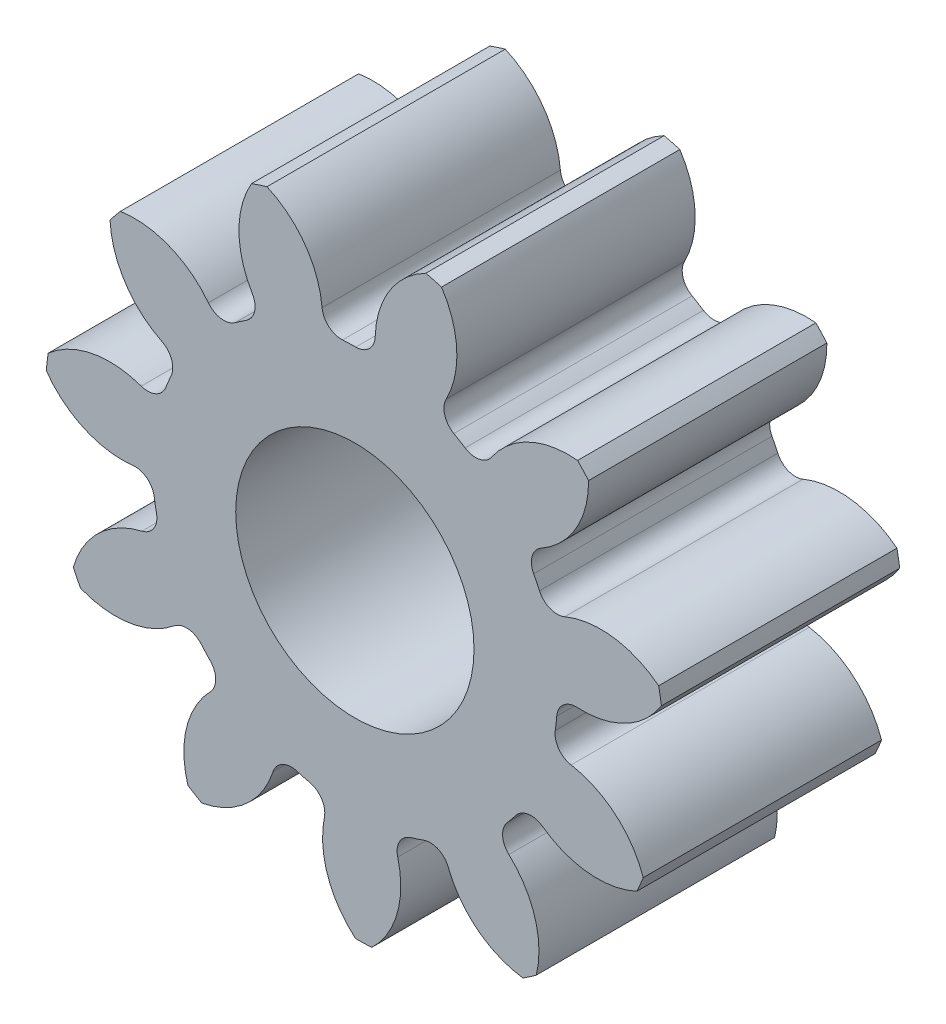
ISO-10303-21;
HEADER;
FILE_DESCRIPTION(('STEP AP214'),'2;1');
FILE_NAME('part.step','',(''),(''),'','','');
FILE_SCHEMA(('AUTOMOTIVE_DESIGN { 1 0 10303 214 1 1 1 1 }'));
ENDSEC;
DATA;
#1=APPLICATION_CONTEXT('core data for automotive mechanical design processes');
#2=APPLICATION_PROTOCOL_DEFINITION('international standard','automotive_design',2000,#1);
#3=PRODUCT_CONTEXT('',#1,'mechanical');
#4=PRODUCT('Part','Part','',(#3));
#5=PRODUCT_RELATED_PRODUCT_CATEGORY('part','',(#4));
#6=PRODUCT_DEFINITION_FORMATION('','',#4);
#7=PRODUCT_DEFINITION_CONTEXT('part definition',#1,'design');
#8=PRODUCT_DEFINITION('design','',#6,#7);
#9=PRODUCT_DEFINITION_SHAPE('','',#8);
#10=(LENGTH_UNIT() NAMED_UNIT(*) SI_UNIT(.MILLI.,.METRE.));
#11=(NAMED_UNIT(*) PLANE_ANGLE_UNIT() SI_UNIT($,.RADIAN.));
#12=(NAMED_UNIT(*) SI_UNIT($,.STERADIAN.) SOLID_ANGLE_UNIT());
#13=UNCERTAINTY_MEASURE_WITH_UNIT(LENGTH_MEASURE(1.E-05),#10,'distance_accuracy_value','');
#14=(GEOMETRIC_REPRESENTATION_CONTEXT(3) GLOBAL_UNCERTAINTY_ASSIGNED_CONTEXT((#13)) GLOBAL_UNIT_ASSIGNED_CONTEXT((#10,
#11,#12)) REPRESENTATION_CONTEXT('',''));
#15=CARTESIAN_POINT('',(0.,0.,0.));
#16=DIRECTION('',(0.,0.,1.));
#17=DIRECTION('',(1.,0.,0.));
#18=AXIS2_PLACEMENT_3D('',#15,#16,#17);
#19=CARTESIAN_POINT('',(0.,0.,101.6));
#20=DIRECTION('',(0.,0.,-1.));
#21=DIRECTION('',(-1.,0.,0.));
#22=AXIS2_PLACEMENT_3D('',#19,#20,#21);
#23=CYLINDRICAL_SURFACE('',#22,132.08);
#24=DIRECTION('',(0.,0.,-1.));
#25=VECTOR('',#24,1.);
#26=CARTESIAN_POINT('',(129.51781702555,25.8894085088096,50.8));
#27=LINE('',#26,#25);
#28=CARTESIAN_POINT('',(129.51781702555,25.8894085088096,101.6));
#29=VERTEX_POINT('',#28);
#30=CARTESIAN_POINT('',(129.51781702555,25.8894085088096,0.));
#31=VERTEX_POINT('',#30);
#32=EDGE_CURVE('E492',#29,#31,#27,.T.);
#33=ORIENTED_EDGE('',*,*,#32,.F.);
#34=CARTESIAN_POINT('',(0.,0.,101.6));
#35=DIRECTION('',(0.,0.,1.));
#36=DIRECTION('',(1.,0.,0.));
#37=AXIS2_PLACEMENT_3D('',#34,#35,#36);
#38=CIRCLE('',#37,132.08);
#39=CARTESIAN_POINT('',(130.696738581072,19.0653855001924,101.6));
#40=VERTEX_POINT('',#39);
#41=EDGE_CURVE('E871',#40,#29,#38,.T.);
#42=ORIENTED_EDGE('',*,*,#41,.F.);
#43=DIRECTION('',(0.,0.,-1.));
#44=VECTOR('',#43,1.);
#45=CARTESIAN_POINT('',(130.696738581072,19.0653855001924,50.8));
#46=LINE('',#45,#44);
#47=CARTESIAN_POINT('',(130.696738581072,19.0653855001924,0.));
#48=VERTEX_POINT('',#47);
#49=EDGE_CURVE('E865',#48,#40,#46,.F.);
#50=ORIENTED_EDGE('',*,*,#49,.F.);
#51=CARTESIAN_POINT('',(0.,0.,0.));
#52=DIRECTION('',(0.,0.,1.));
#53=DIRECTION('',(1.,0.,0.));
#54=AXIS2_PLACEMENT_3D('',#51,#52,#53);
#55=CIRCLE('',#54,132.08);
#56=EDGE_CURVE('E876',#48,#31,#55,.T.);
#57=ORIENTED_EDGE('',*,*,#56,.T.);
#58=EDGE_LOOP('',(#33,#42,#50,#57));
#59=FACE_BOUND('',#58,.T.);
#60=ADVANCED_FACE('F33',(#59),#23,.T.);
#61=DIRECTION('',(0.,0.,-1.));
#62=VECTOR('',#61,1.);
#63=CARTESIAN_POINT('',(99.6415674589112,86.6988144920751,50.8));
#64=LINE('',#63,#62);
#65=CARTESIAN_POINT('',(99.6415674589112,86.6988144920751,0.));
#66=VERTEX_POINT('',#65);
#67=CARTESIAN_POINT('',(99.6415674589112,86.6988144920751,101.6));
#68=VERTEX_POINT('',#67);
#69=EDGE_CURVE('E463',#66,#68,#64,.F.);
#70=ORIENTED_EDGE('',*,*,#69,.F.);
#71=CARTESIAN_POINT('',(94.960450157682,91.802174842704,0.));
#72=VERTEX_POINT('',#71);
#73=EDGE_CURVE('E879',#66,#72,#55,.T.);
#74=ORIENTED_EDGE('',*,*,#73,.T.);
#75=DIRECTION('',(0.,0.,-1.));
#76=VECTOR('',#75,1.);
#77=CARTESIAN_POINT('',(94.960450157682,91.802174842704,50.8));
#78=LINE('',#77,#76);
#79=CARTESIAN_POINT('',(94.960450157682,91.802174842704,101.6));
#80=VERTEX_POINT('',#79);
#81=EDGE_CURVE('E525',#80,#72,#78,.T.);
#82=ORIENTED_EDGE('',*,*,#81,.F.);
#83=EDGE_CURVE('E874',#68,#80,#38,.T.);
#84=ORIENTED_EDGE('',*,*,#83,.F.);
#85=EDGE_LOOP('',(#70,#74,#82,#84));
#86=FACE_BOUND('',#85,.T.);
#87=ADVANCED_FACE('F1006',(#86),#23,.T.);
#88=CARTESIAN_POINT('',(0.,0.,101.6));
#89=DIRECTION('',(0.,0.,1.));
#90=DIRECTION('',(1.,0.,0.));
#91=AXIS2_PLACEMENT_3D('',#88,#89,#90);
#92=PLANE('',#91);
#93=CARTESIAN_POINT('',(0.,0.,101.599999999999));
#94=DIRECTION('',(0.,0.,1.));
#95=DIRECTION('',(1.,0.,0.));
#96=AXIS2_PLACEMENT_3D('',#93,#94,#95);
#97=CIRCLE('',#96,50.8);
#98=CARTESIAN_POINT('',(50.8,0.,101.599999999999));
#99=VERTEX_POINT('',#98);
#100=EDGE_CURVE('E480',#99,#99,#97,.T.);
#101=ORIENTED_EDGE('',*,*,#100,.F.);
#102=EDGE_LOOP('',(#101));
#103=FACE_BOUND('',#102,.T.);
#104=ORIENTED_EDGE('',*,*,#41,.T.);
#105=CARTESIAN_POINT('',(104.885868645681,-5.3070606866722,101.6));
#106=DIRECTION('',(0.,0.,-1.));
#107=DIRECTION('',(0.841253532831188,0.540640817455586,0.));
#108=AXIS2_PLACEMENT_3D('',#105,#106,#107);
#109=CIRCLE('',#108,39.7486172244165);
#110=CARTESIAN_POINT('',(89.4550770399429,31.3241178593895,101.6));
#111=VERTEX_POINT('',#110);
#112=EDGE_CURVE('E472',#111,#29,#109,.T.);
#113=ORIENTED_EDGE('',*,*,#112,.F.);
#114=CARTESIAN_POINT('',(86.2444911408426,38.9457323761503,101.6));
#115=DIRECTION('',(0.,0.,1.));
#116=DIRECTION('',(-0.841253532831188,-0.540640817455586,0.));
#117=AXIS2_PLACEMENT_3D('',#114,#115,#116);
#118=CIRCLE('',#117,8.27023999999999);
#119=CARTESIAN_POINT('',(78.7071263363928,35.5420576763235,101.6));
#120=VERTEX_POINT('',#119);
#121=EDGE_CURVE('E470',#120,#111,#118,.T.);
#122=ORIENTED_EDGE('',*,*,#121,.F.);
#123=CARTESIAN_POINT('',(0.,0.,101.6));
#124=DIRECTION('',(0.,0.,-1.));
#125=DIRECTION('',(0.841253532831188,0.540640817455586,0.));
#126=AXIS2_PLACEMENT_3D('',#123,#124,#125);
#127=CIRCLE('',#126,86.36);
#128=CARTESIAN_POINT('',(76.2315395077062,40.5808080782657,101.6));
#129=VERTEX_POINT('',#128);
#130=EDGE_CURVE('E455',#129,#120,#127,.T.);
#131=ORIENTED_EDGE('',*,*,#130,.F.);
#132=CARTESIAN_POINT('',(83.5318304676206,44.467017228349,101.6));
#133=DIRECTION('',(0.,0.,1.));
#134=DIRECTION('',(-0.841253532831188,-0.540640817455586,0.));
#135=AXIS2_PLACEMENT_3D('',#132,#133,#134);
#136=CIRCLE('',#135,8.27024);
#137=CARTESIAN_POINT('',(79.4609361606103,51.6659538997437,101.6));
#138=VERTEX_POINT('',#137);
#139=EDGE_CURVE('E447',#138,#129,#136,.T.);
#140=ORIENTED_EDGE('',*,*,#139,.F.);
#141=CARTESIAN_POINT('',(59.8953105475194,86.2656484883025,101.6));
#142=DIRECTION('',(0.,0.,-1.));
#143=DIRECTION('',(-0.841253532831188,-0.540640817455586,0.));
#144=AXIS2_PLACEMENT_3D('',#141,#142,#143);
#145=CIRCLE('',#144,39.7486172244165);
#146=EDGE_CURVE('E477',#68,#138,#145,.T.);
#147=ORIENTED_EDGE('',*,*,#146,.F.);
#148=ORIENTED_EDGE('',*,*,#83,.T.);
#149=CARTESIAN_POINT('',(91.1048211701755,52.2409982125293,101.6));
#150=DIRECTION('',(0.,0.,-1.));
#151=DIRECTION('',(0.415415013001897,0.909631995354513,0.));
#152=AXIS2_PLACEMENT_3D('',#149,#150,#151);
#153=CIRCLE('',#152,39.7486172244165);
#154=CARTESIAN_POINT('',(58.3193029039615,74.7145907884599,101.6));
#155=VERTEX_POINT('',#154);
#156=EDGE_CURVE('E501',#155,#80,#153,.T.);
#157=ORIENTED_EDGE('',*,*,#156,.F.);
#158=CARTESIAN_POINT('',(51.4978302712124,79.3905271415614,101.6));
#159=DIRECTION('',(0.,0.,1.));
#160=DIRECTION('',(-0.415415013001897,-0.909631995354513,0.));
#161=AXIS2_PLACEMENT_3D('',#158,#159,#160);
#162=CIRCLE('',#161,8.27023999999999);
#163=CARTESIAN_POINT('',(46.9971609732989,72.4521667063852,101.6));
#164=VERTEX_POINT('',#163);
#165=EDGE_CURVE('E499',#164,#155,#162,.T.);
#166=ORIENTED_EDGE('',*,*,#165,.F.);
#167=CARTESIAN_POINT('',(0.,0.,101.6));
#168=DIRECTION('',(0.,0.,-1.));
#169=DIRECTION('',(0.415415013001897,0.909631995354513,0.));
#170=AXIS2_PLACEMENT_3D('',#167,#168,#169);
#171=CIRCLE('',#170,86.36);
#172=CARTESIAN_POINT('',(42.1904106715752,75.3526299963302,101.6));
#173=VERTEX_POINT('',#172);
#174=EDGE_CURVE('E496',#173,#164,#171,.T.);
#175=ORIENTED_EDGE('',*,*,#174,.F.);
#176=CARTESIAN_POINT('',(46.2307629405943,82.5687524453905,101.6));
#177=DIRECTION('',(0.,0.,1.));
#178=DIRECTION('',(-0.415415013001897,-0.909631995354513,0.));
#179=AXIS2_PLACEMENT_3D('',#176,#177,#178);
#180=CIRCLE('',#179,8.27024);
#181=CARTESIAN_POINT('',(38.9140697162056,86.4239917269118,101.6));
#182=VERTEX_POINT('',#181);
#183=EDGE_CURVE('E494',#182,#173,#180,.T.);
#184=ORIENTED_EDGE('',*,*,#183,.F.);
#185=CARTESIAN_POINT('',(3.74841088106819,104.953131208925,101.6));
#186=DIRECTION('',(0.,0.,-1.));
#187=DIRECTION('',(-0.415415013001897,-0.909631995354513,0.));
#188=AXIS2_PLACEMENT_3D('',#185,#186,#187);
#189=CIRCLE('',#188,39.7486172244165);
#190=CARTESIAN_POINT('',(36.9509027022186,126.805982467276,101.6));
#191=VERTEX_POINT('',#190);
#192=EDGE_CURVE('E504',#191,#182,#189,.T.);
#193=ORIENTED_EDGE('',*,*,#192,.F.);
#194=CARTESIAN_POINT('',(30.2538113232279,128.568399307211,101.6));
#195=VERTEX_POINT('',#194);
#196=EDGE_CURVE('E909',#191,#195,#38,.T.);
#197=ORIENTED_EDGE('',*,*,#196,.T.);
#198=CARTESIAN_POINT('',(48.3986366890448,93.2029092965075,101.6));
#199=DIRECTION('',(0.,0.,-1.));
#200=DIRECTION('',(-0.142314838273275,0.989821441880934,0.));
#201=AXIS2_PLACEMENT_3D('',#198,#199,#200);
#202=CIRCLE('',#201,39.7486172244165);
#203=CARTESIAN_POINT('',(8.66756216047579,94.3837090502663,101.6));
#204=VERTEX_POINT('',#203);
#205=EDGE_CURVE('E536',#204,#195,#202,.T.);
#206=ORIENTED_EDGE('',*,*,#205,.F.);
#207=CARTESIAN_POINT('',(0.400972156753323,94.6293904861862,101.6));
#208=DIRECTION('',(0.,0.,1.));
#209=DIRECTION('',(0.142314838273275,-0.989821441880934,0.));
#210=AXIS2_PLACEMENT_3D('',#207,#208,#209);
#211=CIRCLE('',#210,8.27023999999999);
#212=CARTESIAN_POINT('',(0.365929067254,86.3592247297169,101.6));
#213=VERTEX_POINT('',#212);
#214=EDGE_CURVE('E534',#213,#204,#211,.T.);
#215=ORIENTED_EDGE('',*,*,#214,.F.);
#216=CARTESIAN_POINT('',(0.,0.,101.6));
#217=DIRECTION('',(0.,0.,-1.));
#218=DIRECTION('',(-0.142314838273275,0.989821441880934,0.));
#219=AXIS2_PLACEMENT_3D('',#216,#217,#218);
#220=CIRCLE('',#219,86.36);
#221=CARTESIAN_POINT('',(-5.24587544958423,86.2005243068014,101.6));
#222=VERTEX_POINT('',#221);
#223=EDGE_CURVE('E531',#222,#213,#220,.T.);
#224=ORIENTED_EDGE('',*,*,#223,.F.);
#225=CARTESIAN_POINT('',(-5.74824516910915,94.4554921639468,101.6));
#226=DIRECTION('',(0.,0.,1.));
#227=DIRECTION('',(0.142314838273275,-0.989821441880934,0.));
#228=AXIS2_PLACEMENT_3D('',#225,#226,#227);
#229=CIRCLE('',#228,8.27024);
#230=CARTESIAN_POINT('',(-13.9877389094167,93.7430228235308,101.6));
#231=VERTEX_POINT('',#230);
#232=EDGE_CURVE('E529',#231,#222,#229,.T.);
#233=ORIENTED_EDGE('',*,*,#232,.F.);
#234=CARTESIAN_POINT('',(-53.5885827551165,90.3187363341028,101.6));
#235=DIRECTION('',(0.,0.,-1.));
#236=DIRECTION('',(0.142314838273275,-0.989821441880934,0.));
#237=AXIS2_PLACEMENT_3D('',#234,#235,#236);
#238=CIRCLE('',#237,39.7486172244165);
#239=CARTESIAN_POINT('',(-37.471412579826,126.653146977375,101.6));
#240=VERTEX_POINT('',#239);
#241=EDGE_CURVE('E539',#240,#231,#238,.T.);
#242=ORIENTED_EDGE('',*,*,#241,.F.);
#243=CARTESIAN_POINT('',(-44.0581988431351,124.515065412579,101.6));
#244=VERTEX_POINT('',#243);
#245=EDGE_CURVE('E988',#240,#244,#38,.T.);
#246=ORIENTED_EDGE('',*,*,#245,.T.);
#247=CARTESIAN_POINT('',(-9.67377297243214,104.573555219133,101.6));
#248=DIRECTION('',(0.,0.,-1.));
#249=DIRECTION('',(-0.654860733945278,0.755749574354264,0.));
#250=AXIS2_PLACEMENT_3D('',#247,#248,#249);
#251=CIRCLE('',#250,39.7486172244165);
#252=CARTESIAN_POINT('',(-43.7360683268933,84.0866665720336,101.6));
#253=VERTEX_POINT('',#252);
#254=EDGE_CURVE('E574',#253,#244,#251,.T.);
#255=ORIENTED_EDGE('',*,*,#254,.F.);
#256=CARTESIAN_POINT('',(-50.8231917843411,79.8240909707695,101.6));
#257=DIRECTION('',(0.,0.,1.));
#258=DIRECTION('',(0.654860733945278,-0.755749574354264,0.));
#259=AXIS2_PLACEMENT_3D('',#256,#257,#258);
#260=CIRCLE('',#259,8.27023999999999);
#261=CARTESIAN_POINT('',(-46.3814827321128,72.8478390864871,101.6));
#262=VERTEX_POINT('',#261);
#263=EDGE_CURVE('E572',#262,#253,#260,.T.);
#264=ORIENTED_EDGE('',*,*,#263,.F.);
#265=CARTESIAN_POINT('',(0.,0.,101.6));
#266=DIRECTION('',(0.,0.,-1.));
#267=DIRECTION('',(-0.654860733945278,0.755749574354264,0.));
#268=AXIS2_PLACEMENT_3D('',#265,#266,#267);
#269=CIRCLE('',#268,86.36);
#270=CARTESIAN_POINT('',(-51.0166331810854,69.6803612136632,101.6));
#271=VERTEX_POINT('',#270);
#272=EDGE_CURVE('E569',#271,#262,#269,.T.);
#273=ORIENTED_EDGE('',*,*,#272,.F.);
#274=CARTESIAN_POINT('',(-55.9022260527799,76.3532805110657,101.6));
#275=DIRECTION('',(0.,0.,1.));
#276=DIRECTION('',(0.654860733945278,-0.755749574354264,0.));
#277=AXIS2_PLACEMENT_3D('',#274,#275,#276);
#278=CIRCLE('',#277,8.27024);
#279=CARTESIAN_POINT('',(-62.4485392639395,71.2993065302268,101.6));
#280=VERTEX_POINT('',#279);
#281=EDGE_CURVE('E567',#280,#271,#278,.T.);
#282=ORIENTED_EDGE('',*,*,#281,.F.);
#283=CARTESIAN_POINT('',(-93.9115800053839,47.0087808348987,101.6));
#284=DIRECTION('',(0.,0.,-1.));
#285=DIRECTION('',(0.654860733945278,-0.755749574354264,0.));
#286=AXIS2_PLACEMENT_3D('',#283,#284,#285);
#287=CIRCLE('',#286,39.7486172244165);
#288=CARTESIAN_POINT('',(-99.9968191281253,86.28883221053,101.6));
#289=VERTEX_POINT('',#288);
#290=EDGE_CURVE('E577',#289,#280,#287,.T.);
#291=ORIENTED_EDGE('',*,*,#290,.F.);
#292=CARTESIAN_POINT('',(-104.38204217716,80.9290780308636,101.6));
#293=VERTEX_POINT('',#292);
#294=EDGE_CURVE('E984',#289,#293,#38,.T.);
#295=ORIENTED_EDGE('',*,*,#294,.T.);
#296=CARTESIAN_POINT('',(-64.6748280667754,82.7428362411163,101.6));
#297=DIRECTION('',(0.,0.,-1.));
#298=DIRECTION('',(-0.959492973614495,0.281732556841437,0.));
#299=AXIS2_PLACEMENT_3D('',#296,#297,#298);
#300=CIRCLE('',#299,39.7486172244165);
#301=CARTESIAN_POINT('',(-82.2538061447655,47.0927015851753,101.6));
#302=VERTEX_POINT('',#301);
#303=EDGE_CURVE('E612',#302,#293,#300,.T.);
#304=ORIENTED_EDGE('',*,*,#303,.F.);
#305=CARTESIAN_POINT('',(-85.9113514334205,39.6752065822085,101.6));
#306=DIRECTION('',(0.,0.,1.));
#307=DIRECTION('',(0.959492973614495,-0.281732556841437,0.));
#308=AXIS2_PLACEMENT_3D('',#305,#306,#307);
#309=CIRCLE('',#308,8.27023999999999);
#310=CARTESIAN_POINT('',(-78.4031014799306,36.2077792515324,101.6));
#311=VERTEX_POINT('',#310);
#312=EDGE_CURVE('E610',#311,#302,#309,.T.);
#313=ORIENTED_EDGE('',*,*,#312,.F.);
#314=CARTESIAN_POINT('',(0.,0.,101.6));
#315=DIRECTION('',(0.,0.,-1.));
#316=DIRECTION('',(-0.959492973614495,0.281732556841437,0.));
#317=AXIS2_PLACEMENT_3D('',#314,#315,#316);
#318=CIRCLE('',#317,86.36);
#319=CARTESIAN_POINT('',(-80.5899703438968,31.0371757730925,101.6));
#320=VERTEX_POINT('',#319);
#321=EDGE_CURVE('E607',#320,#311,#318,.T.);
#322=ORIENTED_EDGE('',*,*,#321,.F.);
#323=CARTESIAN_POINT('',(-88.3076451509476,34.0094417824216,101.6));
#324=DIRECTION('',(0.,0.,1.));
#325=DIRECTION('',(0.959492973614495,-0.281732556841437,0.));
#326=AXIS2_PLACEMENT_3D('',#323,#324,#325);
#327=CIRCLE('',#326,8.27024);
#328=CARTESIAN_POINT('',(-91.0823696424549,26.2185641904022,101.6));
#329=VERTEX_POINT('',#328);
#330=EDGE_CURVE('E605',#329,#320,#327,.T.);
#331=ORIENTED_EDGE('',*,*,#330,.F.);
#332=CARTESIAN_POINT('',(-104.418314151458,-11.2261304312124,101.6));
#333=DIRECTION('',(0.,0.,-1.));
#334=DIRECTION('',(0.959492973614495,-0.281732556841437,0.));
#335=AXIS2_PLACEMENT_3D('',#332,#333,#334);
#336=CIRCLE('',#335,39.7486172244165);
#337=CARTESIAN_POINT('',(-130.773942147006,18.5284229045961,101.6));
#338=VERTEX_POINT('',#337);
#339=EDGE_CURVE('E615',#338,#329,#336,.T.);
#340=ORIENTED_EDGE('',*,*,#339,.F.);
#341=CARTESIAN_POINT('',(-131.565324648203,11.6486801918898,101.6));
#342=VERTEX_POINT('',#341);
#343=EDGE_CURVE('E980',#338,#342,#38,.T.);
#344=ORIENTED_EDGE('',*,*,#343,.T.);
#345=CARTESIAN_POINT('',(-99.1420822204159,34.6418513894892,101.6));
#346=DIRECTION('',(0.,0.,-1.));
#347=DIRECTION('',(-0.959492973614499,-0.281732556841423,0.));
#348=AXIS2_PLACEMENT_3D('',#345,#346,#347);
#349=CIRCLE('',#348,39.7486172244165);
#350=CARTESIAN_POINT('',(-94.6565416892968,-4.85286341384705,101.6));
#351=VERTEX_POINT('',#350);
#352=EDGE_CURVE('E650',#351,#342,#349,.T.);
#353=ORIENTED_EDGE('',*,*,#352,.F.);
#354=CARTESIAN_POINT('',(-93.723264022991,-13.0702755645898,101.6));
#355=DIRECTION('',(0.,0.,1.));
#356=DIRECTION('',(0.959492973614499,0.281732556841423,0.));
#357=AXIS2_PLACEMENT_3D('',#354,#355,#356);
#358=CIRCLE('',#357,8.27023999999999);
#359=CARTESIAN_POINT('',(-85.5322894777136,-11.9279946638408,101.6));
#360=VERTEX_POINT('',#359);
#361=EDGE_CURVE('E648',#360,#351,#358,.T.);
#362=ORIENTED_EDGE('',*,*,#361,.F.);
#363=CARTESIAN_POINT('',(0.,0.,101.6));
#364=DIRECTION('',(0.,0.,-1.));
#365=DIRECTION('',(-0.959492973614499,-0.281732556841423,0.));
#366=AXIS2_PLACEMENT_3D('',#363,#364,#365);
#367=CIRCLE('',#366,86.36);
#368=CARTESIAN_POINT('',(-84.5765613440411,-17.4600936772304,101.6));
#369=VERTEX_POINT('',#368);
#370=EDGE_CURVE('E645',#369,#360,#367,.T.);
#371=ORIENTED_EDGE('',*,*,#370,.F.);
#372=CARTESIAN_POINT('',(-92.6760108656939,-19.1321544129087,101.6));
#373=DIRECTION('',(0.,0.,1.));
#374=DIRECTION('',(0.959492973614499,0.281732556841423,0.));
#375=AXIS2_PLACEMENT_3D('',#372,#373,#374);
#376=CIRCLE('',#375,8.27024);
#377=CARTESIAN_POINT('',(-90.7981912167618,-27.1863870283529,101.6));
#378=VERTEX_POINT('',#377);
#379=EDGE_CURVE('E643',#378,#369,#376,.T.);
#380=ORIENTED_EDGE('',*,*,#379,.F.);
#381=CARTESIAN_POINT('',(-81.7729713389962,-65.8968246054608,101.6));
#382=DIRECTION('',(0.,0.,-1.));
#383=DIRECTION('',(0.959492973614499,0.281732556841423,0.));
#384=AXIS2_PLACEMENT_3D('',#381,#382,#383);
#385=CIRCLE('',#384,39.7486172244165);
#386=CARTESIAN_POINT('',(-120.031262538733,-55.1146297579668,101.6));
#387=VERTEX_POINT('',#386);
#388=EDGE_CURVE('E653',#387,#378,#385,.T.);
#389=ORIENTED_EDGE('',*,*,#388,.F.);
#390=CARTESIAN_POINT('',(-116.977546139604,-61.3300913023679,101.6));
#391=VERTEX_POINT('',#390);
#392=EDGE_CURVE('E976',#387,#391,#38,.T.);
#393=ORIENTED_EDGE('',*,*,#392,.T.);
#394=CARTESIAN_POINT('',(-102.132425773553,-24.4576765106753,101.6));
#395=DIRECTION('',(0.,0.,-1.));
#396=DIRECTION('',(-0.654860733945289,-0.755749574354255,0.));
#397=AXIS2_PLACEMENT_3D('',#394,#395,#396);
#398=CIRCLE('',#397,39.7486172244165);
#399=CARTESIAN_POINT('',(-77.0064940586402,-55.2576785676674,101.6));
#400=VERTEX_POINT('',#399);
#401=EDGE_CURVE('E688',#400,#391,#398,.T.);
#402=ORIENTED_EDGE('',*,*,#401,.F.);
#403=CARTESIAN_POINT('',(-71.7787025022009,-61.666037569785,101.6));
#404=DIRECTION('',(0.,0.,1.));
#405=DIRECTION('',(0.654860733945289,0.755749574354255,0.));
#406=AXIS2_PLACEMENT_3D('',#403,#404,#405);
#407=CIRCLE('',#406,8.27023999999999);
#408=CARTESIAN_POINT('',(-65.5055799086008,-56.2767145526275,101.6));
#409=VERTEX_POINT('',#408);
#410=EDGE_CURVE('E686',#409,#400,#407,.T.);
#411=ORIENTED_EDGE('',*,*,#410,.F.);
#412=CARTESIAN_POINT('',(0.,0.,101.6));
#413=DIRECTION('',(0.,0.,-1.));
#414=DIRECTION('',(-0.654860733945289,-0.755749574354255,0.));
#415=AXIS2_PLACEMENT_3D('',#412,#413,#414);
#416=CIRCLE('',#415,86.36);
#417=CARTESIAN_POINT('',(-61.7106917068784,-60.4139067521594,101.6));
#418=VERTEX_POINT('',#417);
#419=EDGE_CURVE('E683',#418,#409,#416,.T.);
#420=ORIENTED_EDGE('',*,*,#419,.F.);
#421=CARTESIAN_POINT('',(-67.6203979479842,-66.1994267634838,101.6));
#422=DIRECTION('',(0.,0.,1.));
#423=DIRECTION('',(0.654860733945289,0.755749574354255,0.));
#424=AXIS2_PLACEMENT_3D('',#421,#422,#423);
#425=CIRCLE('',#424,8.27024);
#426=CARTESIAN_POINT('',(-61.6862286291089,-71.9598524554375,101.6));
#427=VERTEX_POINT('',#426);
#428=EDGE_CURVE('E681',#427,#418,#425,.T.);
#429=ORIENTED_EDGE('',*,*,#428,.F.);
#430=CARTESIAN_POINT('',(-33.1652879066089,-99.6457425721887,101.6));
#431=DIRECTION('',(0.,0.,-1.));
#432=DIRECTION('',(0.654860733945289,0.755749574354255,0.));
#433=AXIS2_PLACEMENT_3D('',#430,#431,#432);
#434=CIRCLE('',#433,39.7486172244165);
#435=CARTESIAN_POINT('',(-71.1795051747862,-111.25917689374,101.6));
#436=VERTEX_POINT('',#435);
#437=EDGE_CURVE('E691',#436,#427,#434,.T.);
#438=ORIENTED_EDGE('',*,*,#437,.F.);
#439=CARTESIAN_POINT('',(-65.2502232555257,-114.836992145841,101.6));
#440=VERTEX_POINT('',#439);
#441=EDGE_CURVE('E972',#436,#440,#38,.T.);
#442=ORIENTED_EDGE('',*,*,#441,.T.);
#443=CARTESIAN_POINT('',(-72.6964457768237,-75.7920649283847,101.6));
#444=DIRECTION('',(0.,0.,-1.));
#445=DIRECTION('',(-0.142314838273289,-0.989821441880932,0.));
#446=AXIS2_PLACEMENT_3D('',#443,#444,#445);
#447=CIRCLE('',#446,39.7486172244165);
#448=CARTESIAN_POINT('',(-34.9074286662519,-88.1185712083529,101.6));
#449=VERTEX_POINT('',#448);
#450=EDGE_CURVE('E726',#449,#440,#447,.T.);
#451=ORIENTED_EDGE('',*,*,#450,.F.);
#452=CARTESIAN_POINT('',(-27.0449101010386,-90.6832683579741,101.6));
#453=DIRECTION('',(0.,0.,1.));
#454=DIRECTION('',(0.142314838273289,0.989821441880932,0.));
#455=AXIS2_PLACEMENT_3D('',#452,#453,#454);
#456=CIRCLE('',#455,8.27023999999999);
#457=CARTESIAN_POINT('',(-24.6813115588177,-82.7579752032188,101.6));
#458=VERTEX_POINT('',#457);
#459=EDGE_CURVE('E724',#458,#449,#456,.T.);
#460=ORIENTED_EDGE('',*,*,#459,.F.);
#461=CARTESIAN_POINT('',(0.,0.,101.6));
#462=DIRECTION('',(0.,0.,-1.));
#463=DIRECTION('',(-0.142314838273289,-0.989821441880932,0.));
#464=AXIS2_PLACEMENT_3D('',#461,#462,#463);
#465=CIRCLE('',#464,86.36);
#466=CARTESIAN_POINT('',(-19.2521134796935,-84.1867312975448,101.6));
#467=VERTEX_POINT('',#466);
#468=EDGE_CURVE('E721',#467,#458,#465,.T.);
#469=ORIENTED_EDGE('',*,*,#468,.F.);
#470=CARTESIAN_POINT('',(-21.09578646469,-92.2488488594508,101.6));
#471=DIRECTION('',(0.,0.,1.));
#472=DIRECTION('',(0.142314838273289,0.989821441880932,0.));
#473=AXIS2_PLACEMENT_3D('',#470,#471,#472);
#474=CIRCLE('',#473,8.27024);
#475=CARTESIAN_POINT('',(-12.9893243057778,-93.8865731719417,101.6));
#476=VERTEX_POINT('',#475);
#477=EDGE_CURVE('E719',#476,#467,#474,.T.);
#478=ORIENTED_EDGE('',*,*,#477,.F.);
#479=CARTESIAN_POINT('',(25.9721401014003,-101.757841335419,101.6));
#480=DIRECTION('',(0.,0.,-1.));
#481=DIRECTION('',(0.142314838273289,0.989821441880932,0.));
#482=AXIS2_PLACEMENT_3D('',#479,#480,#481);
#483=CIRCLE('',#482,39.7486172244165);
#484=CARTESIAN_POINT('',(0.27124215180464,-132.07972148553,101.6));
#485=VERTEX_POINT('',#484);
#486=EDGE_CURVE('E729',#485,#476,#483,.T.);
#487=ORIENTED_EDGE('',*,*,#486,.F.);
#488=CARTESIAN_POINT('',(7.19358447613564,-131.883959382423,101.6));
#489=VERTEX_POINT('',#488);
#490=EDGE_CURVE('E968',#485,#489,#38,.T.);
#491=ORIENTED_EDGE('',*,*,#490,.T.);
#492=CARTESIAN_POINT('',(-20.1798578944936,-103.063008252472,101.6));
#493=DIRECTION('',(0.,0.,-1.));
#494=DIRECTION('',(0.415415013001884,-0.909631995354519,0.));
#495=AXIS2_PLACEMENT_3D('',#492,#493,#494);
#496=CIRCLE('',#495,39.7486172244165);
#497=CARTESIAN_POINT('',(18.2744986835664,-93.0024401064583,101.6));
#498=VERTEX_POINT('',#497);
#499=EDGE_CURVE('E764',#498,#489,#496,.T.);
#500=ORIENTED_EDGE('',*,*,#499,.F.);
#501=CARTESIAN_POINT('',(26.2754501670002,-90.9092021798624,101.6));
#502=DIRECTION('',(0.,0.,1.));
#503=DIRECTION('',(-0.415415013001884,0.909631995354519,0.));
#504=AXIS2_PLACEMENT_3D('',#501,#502,#503);
#505=CIRCLE('',#504,8.27023999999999);
#506=CARTESIAN_POINT('',(23.9790988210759,-82.9641634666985,101.6));
#507=VERTEX_POINT('',#506);
#508=EDGE_CURVE('E762',#507,#498,#505,.T.);
#509=ORIENTED_EDGE('',*,*,#508,.F.);
#510=CARTESIAN_POINT('',(0.,0.,101.6));
#511=DIRECTION('',(0.,0.,-1.));
#512=DIRECTION('',(0.415415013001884,-0.909631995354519,0.));
#513=AXIS2_PLACEMENT_3D('',#510,#511,#512);
#514=CIRCLE('',#513,86.36);
#515=CARTESIAN_POINT('',(29.3188747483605,-81.2308634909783,101.6));
#516=VERTEX_POINT('',#515);
#517=EDGE_CURVE('E759',#516,#507,#514,.T.);
#518=ORIENTED_EDGE('',*,*,#517,.F.);
#519=CARTESIAN_POINT('',(32.1265881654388,-89.0099132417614,101.6));
#520=DIRECTION('',(0.,0.,1.));
#521=DIRECTION('',(-0.415415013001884,0.909631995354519,0.));
#522=AXIS2_PLACEMENT_3D('',#519,#520,#521);
#523=CIRCLE('',#522,8.27024);
#524=CARTESIAN_POINT('',(39.831598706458,-86.0049702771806,101.6));
#525=VERTEX_POINT('',#524);
#526=EDGE_CURVE('E757',#525,#516,#523,.T.);
#527=ORIENTED_EDGE('',*,*,#526,.F.);
#528=CARTESIAN_POINT('',(76.8635971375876,-71.5625444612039,101.6));
#529=DIRECTION('',(0.,0.,-1.));
#530=DIRECTION('',(-0.415415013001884,0.909631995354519,0.));
#531=AXIS2_PLACEMENT_3D('',#528,#529,#530);
#532=CIRCLE('',#531,39.7486172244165);
#533=CARTESIAN_POINT('',(71.6358720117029,-110.96588773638,101.6));
#534=VERTEX_POINT('',#533);
#535=EDGE_CURVE('E767',#534,#525,#532,.T.);
#536=ORIENTED_EDGE('',*,*,#535,.F.);
#537=CARTESIAN_POINT('',(77.353479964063,-107.058701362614,101.6));
#538=VERTEX_POINT('',#537);
#539=EDGE_CURVE('E967',#534,#538,#38,.T.);
#540=ORIENTED_EDGE('',*,*,#539,.T.);
#541=CARTESIAN_POINT('',(38.7436922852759,-97.6121746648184,101.6));
#542=DIRECTION('',(0.,0.,-1.));
#543=DIRECTION('',(0.841253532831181,-0.540640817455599,0.));
#544=AXIS2_PLACEMENT_3D('',#541,#542,#543);
#545=CIRCLE('',#544,39.7486172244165);
#546=CARTESIAN_POINT('',(65.65440182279,-68.3586913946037,101.6));
#547=VERTEX_POINT('',#546);
#548=EDGE_CURVE('E802',#547,#538,#545,.T.);
#549=ORIENTED_EDGE('',*,*,#548,.F.);
#550=CARTESIAN_POINT('',(71.2535406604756,-62.2721066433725,101.6));
#551=DIRECTION('',(0.,0.,1.));
#552=DIRECTION('',(-0.841253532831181,0.540640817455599,0.));
#553=AXIS2_PLACEMENT_3D('',#550,#551,#552);
#554=CIRCLE('',#553,8.27023999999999);
#555=CARTESIAN_POINT('',(65.0263147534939,-56.8298160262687,101.6));
#556=VERTEX_POINT('',#555);
#557=EDGE_CURVE('E800',#556,#547,#554,.T.);
#558=ORIENTED_EDGE('',*,*,#557,.F.);
#559=CARTESIAN_POINT('',(0.,0.,101.6));
#560=DIRECTION('',(0.,0.,-1.));
#561=DIRECTION('',(0.841253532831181,-0.540640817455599,0.));
#562=AXIS2_PLACEMENT_3D('',#559,#560,#561);
#563=CIRCLE('',#562,86.36);
#564=CARTESIAN_POINT('',(68.5813274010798,-52.484770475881,101.6));
#565=VERTEX_POINT('',#564);
#566=EDGE_CURVE('E797',#565,#556,#563,.T.);
#567=ORIENTED_EDGE('',*,*,#566,.F.);
#568=CARTESIAN_POINT('',(75.1489980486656,-57.5109590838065,101.6));
#569=DIRECTION('',(0.,0.,1.));
#570=DIRECTION('',(-0.841253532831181,0.540640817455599,0.));
#571=AXIS2_PLACEMENT_3D('',#568,#569,#570);
#572=CIRCLE('',#571,8.27024);
#573=CARTESIAN_POINT('',(80.0062705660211,-50.8173970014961,101.6));
#574=VERTEX_POINT('',#573);
#575=EDGE_CURVE('E795',#574,#565,#572,.T.);
#576=ORIENTED_EDGE('',*,*,#575,.F.);
#577=CARTESIAN_POINT('',(103.351405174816,-18.646645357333,101.6));
#578=DIRECTION('',(0.,0.,-1.));
#579=DIRECTION('',(-0.841253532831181,0.540640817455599,0.));
#580=AXIS2_PLACEMENT_3D('',#577,#578,#579);
#581=CIRCLE('',#580,39.7486172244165);
#582=CARTESIAN_POINT('',(120.25661866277,-54.6211686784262,101.6));
#583=VERTEX_POINT('',#582);
#584=EDGE_CURVE('E805',#583,#574,#581,.T.);
#585=ORIENTED_EDGE('',*,*,#584,.F.);
#586=CARTESIAN_POINT('',(122.954192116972,-48.2430621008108,101.6));
#587=VERTEX_POINT('',#586);
#588=EDGE_CURVE('E875',#583,#587,#38,.T.);
#589=ORIENTED_EDGE('',*,*,#588,.T.);
#590=CARTESIAN_POINT('',(85.3663939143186,-61.1701653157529,101.6));
#591=DIRECTION('',(0.,0.,-1.));
#592=DIRECTION('',(1.,0.,0.));
#593=AXIS2_PLACEMENT_3D('',#590,#591,#592);
#594=CIRCLE('',#593,39.7486172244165);
#595=CARTESIAN_POINT('',(92.1894962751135,-22.0115411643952,101.6));
#596=VERTEX_POINT('',#595);
#597=EDGE_CURVE('E840',#596,#587,#594,.T.);
#598=ORIENTED_EDGE('',*,*,#597,.F.);
#599=CARTESIAN_POINT('',(93.6091354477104,-13.8640572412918,101.6));
#600=DIRECTION('',(0.,0.,1.));
#601=DIRECTION('',(-1.,0.,0.));
#602=AXIS2_PLACEMENT_3D('',#599,#600,#601);
#603=CIRCLE('',#602,8.27023999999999);
#604=CARTESIAN_POINT('',(85.4281352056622,-12.6524035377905,101.6));
#605=VERTEX_POINT('',#604);
#606=EDGE_CURVE('E838',#605,#596,#603,.T.);
#607=ORIENTED_EDGE('',*,*,#606,.F.);
#608=CARTESIAN_POINT('',(0.,0.,101.6));
#609=DIRECTION('',(0.,0.,-1.));
#610=DIRECTION('',(1.,0.,0.));
#611=AXIS2_PLACEMENT_3D('',#608,#609,#610);
#612=CIRCLE('',#611,86.36);
#613=CARTESIAN_POINT('',(86.06969317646,-7.07513367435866,101.6));
#614=VERTEX_POINT('',#613);
#615=EDGE_CURVE('E835',#614,#605,#612,.T.);
#616=ORIENTED_EDGE('',*,*,#615,.F.);
#617=CARTESIAN_POINT('',(94.312132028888,-7.75268176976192,101.6));
#618=DIRECTION('',(0.,0.,1.));
#619=DIRECTION('',(-1.,0.,0.));
#620=AXIS2_PLACEMENT_3D('',#617,#618,#619);
#621=CIRCLE('',#620,8.27024);
#622=CARTESIAN_POINT('',(94.779516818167,0.504340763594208,101.6));
#623=VERTEX_POINT('',#622);
#624=EDGE_CURVE('E833',#623,#614,#621,.T.);
#625=ORIENTED_EDGE('',*,*,#624,.F.);
#626=CARTESIAN_POINT('',(97.025872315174,40.1894318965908,101.6));
#627=DIRECTION('',(0.,0.,-1.));
#628=DIRECTION('',(-1.,0.,0.));
#629=AXIS2_PLACEMENT_3D('',#626,#627,#628);
#630=CIRCLE('',#629,39.7486172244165);
#631=EDGE_CURVE('E843',#40,#623,#630,.T.);
#632=ORIENTED_EDGE('',*,*,#631,.F.);
#633=EDGE_LOOP('',(#104,#113,#122,#131,#140,#147,#148,#157,#166,#175,#184,#193,#197,#206,#215,
#224,#233,#242,#246,#255,#264,#273,#282,#291,#295,#304,#313,#322,#331,#340,#344,#353,#362,#371,
#380,#389,#393,#402,#411,#420,#429,#438,#442,#451,#460,#469,#478,#487,#491,#500,#509,#518,#527,
#536,#540,#549,#558,#567,#576,#585,#589,#598,#607,#616,#625,#632));
#634=FACE_BOUND('',#633,.T.);
#635=ADVANCED_FACE('F468',(#103,#634),#92,.T.);
#636=CARTESIAN_POINT('',(0.,0.,0.));
#637=DIRECTION('',(0.,0.,1.));
#638=DIRECTION('',(1.,0.,0.));
#639=AXIS2_PLACEMENT_3D('',#636,#637,#638);
#640=PLANE('',#639);
#641=CARTESIAN_POINT('',(0.,0.,0.));
#642=DIRECTION('',(0.,0.,1.));
#643=DIRECTION('',(1.,0.,0.));
#644=AXIS2_PLACEMENT_3D('',#641,#642,#643);
#645=CIRCLE('',#644,50.8);
#646=CARTESIAN_POINT('',(50.8,0.,-1.77635683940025E-12));
#647=VERTEX_POINT('',#646);
#648=EDGE_CURVE('E36',#647,#647,#645,.T.);
#649=ORIENTED_EDGE('',*,*,#648,.T.);
#650=EDGE_LOOP('',(#649));
#651=FACE_BOUND('',#650,.T.);
#652=CARTESIAN_POINT('',(104.885868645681,-5.3070606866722,0.));
#653=DIRECTION('',(0.,0.,-1.));
#654=DIRECTION('',(0.841253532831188,0.540640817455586,0.));
#655=AXIS2_PLACEMENT_3D('',#652,#653,#654);
#656=CIRCLE('',#655,39.7486172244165);
#657=CARTESIAN_POINT('',(89.4550770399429,31.3241178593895,0.));
#658=VERTEX_POINT('',#657);
#659=EDGE_CURVE('E456',#658,#31,#656,.T.);
#660=ORIENTED_EDGE('',*,*,#659,.T.);
#661=ORIENTED_EDGE('',*,*,#56,.F.);
#662=CARTESIAN_POINT('',(97.025872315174,40.1894318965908,0.));
#663=DIRECTION('',(0.,0.,1.));
#664=DIRECTION('',(1.,0.,0.));
#665=AXIS2_PLACEMENT_3D('',#662,#663,#664);
#666=CIRCLE('',#665,39.7486172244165);
#667=CARTESIAN_POINT('',(94.779516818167,0.504340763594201,0.));
#668=VERTEX_POINT('',#667);
#669=EDGE_CURVE('E873',#668,#48,#666,.T.);
#670=ORIENTED_EDGE('',*,*,#669,.F.);
#671=CARTESIAN_POINT('',(94.312132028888,-7.75268176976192,0.));
#672=DIRECTION('',(0.,0.,1.));
#673=DIRECTION('',(-1.,0.,0.));
#674=AXIS2_PLACEMENT_3D('',#671,#672,#673);
#675=CIRCLE('',#674,8.27024);
#676=CARTESIAN_POINT('',(86.06969317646,-7.07513367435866,0.));
#677=VERTEX_POINT('',#676);
#678=EDGE_CURVE('E832',#668,#677,#675,.T.);
#679=ORIENTED_EDGE('',*,*,#678,.T.);
#680=CARTESIAN_POINT('',(0.,0.,0.));
#681=DIRECTION('',(0.,0.,-1.));
#682=DIRECTION('',(1.,0.,0.));
#683=AXIS2_PLACEMENT_3D('',#680,#681,#682);
#684=CIRCLE('',#683,86.36);
#685=CARTESIAN_POINT('',(85.4281352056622,-12.6524035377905,0.));
#686=VERTEX_POINT('',#685);
#687=EDGE_CURVE('E848',#677,#686,#684,.T.);
#688=ORIENTED_EDGE('',*,*,#687,.T.);
#689=CARTESIAN_POINT('',(93.6091354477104,-13.8640572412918,0.));
#690=DIRECTION('',(0.,0.,1.));
#691=DIRECTION('',(-1.,0.,0.));
#692=AXIS2_PLACEMENT_3D('',#689,#690,#691);
#693=CIRCLE('',#692,8.27023999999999);
#694=CARTESIAN_POINT('',(92.1894962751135,-22.0115411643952,0.));
#695=VERTEX_POINT('',#694);
#696=EDGE_CURVE('E851',#686,#695,#693,.T.);
#697=ORIENTED_EDGE('',*,*,#696,.T.);
#698=CARTESIAN_POINT('',(85.3663939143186,-61.1701653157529,0.));
#699=DIRECTION('',(0.,0.,-1.));
#700=DIRECTION('',(1.,0.,0.));
#701=AXIS2_PLACEMENT_3D('',#698,#699,#700);
#702=CIRCLE('',#701,39.7486172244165);
#703=CARTESIAN_POINT('',(122.954192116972,-48.2430621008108,0.));
#704=VERTEX_POINT('',#703);
#705=EDGE_CURVE('E836',#695,#704,#702,.T.);
#706=ORIENTED_EDGE('',*,*,#705,.T.);
#707=CARTESIAN_POINT('',(120.25661866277,-54.6211686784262,0.));
#708=VERTEX_POINT('',#707);
#709=EDGE_CURVE('E870',#708,#704,#55,.T.);
#710=ORIENTED_EDGE('',*,*,#709,.F.);
#711=CARTESIAN_POINT('',(103.351405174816,-18.646645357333,0.));
#712=DIRECTION('',(0.,0.,1.));
#713=DIRECTION('',(1.,0.,0.));
#714=AXIS2_PLACEMENT_3D('',#711,#712,#713);
#715=CIRCLE('',#714,39.7486172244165);
#716=CARTESIAN_POINT('',(80.0062705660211,-50.8173970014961,0.));
#717=VERTEX_POINT('',#716);
#718=EDGE_CURVE('E881',#717,#708,#715,.T.);
#719=ORIENTED_EDGE('',*,*,#718,.F.);
#720=CARTESIAN_POINT('',(75.1489980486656,-57.5109590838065,0.));
#721=DIRECTION('',(0.,0.,1.));
#722=DIRECTION('',(-0.841253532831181,0.540640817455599,0.));
#723=AXIS2_PLACEMENT_3D('',#720,#721,#722);
#724=CIRCLE('',#723,8.27024);
#725=CARTESIAN_POINT('',(68.5813274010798,-52.484770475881,0.));
#726=VERTEX_POINT('',#725);
#727=EDGE_CURVE('E794',#717,#726,#724,.T.);
#728=ORIENTED_EDGE('',*,*,#727,.T.);
#729=CARTESIAN_POINT('',(0.,0.,0.));
#730=DIRECTION('',(0.,0.,-1.));
#731=DIRECTION('',(0.841253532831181,-0.540640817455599,0.));
#732=AXIS2_PLACEMENT_3D('',#729,#730,#731);
#733=CIRCLE('',#732,86.36);
#734=CARTESIAN_POINT('',(65.0263147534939,-56.8298160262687,0.));
#735=VERTEX_POINT('',#734);
#736=EDGE_CURVE('E810',#726,#735,#733,.T.);
#737=ORIENTED_EDGE('',*,*,#736,.T.);
#738=CARTESIAN_POINT('',(71.2535406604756,-62.2721066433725,0.));
#739=DIRECTION('',(0.,0.,1.));
#740=DIRECTION('',(-0.841253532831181,0.540640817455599,0.));
#741=AXIS2_PLACEMENT_3D('',#738,#739,#740);
#742=CIRCLE('',#741,8.27023999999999);
#743=CARTESIAN_POINT('',(65.65440182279,-68.3586913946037,0.));
#744=VERTEX_POINT('',#743);
#745=EDGE_CURVE('E813',#735,#744,#742,.T.);
#746=ORIENTED_EDGE('',*,*,#745,.T.);
#747=CARTESIAN_POINT('',(38.7436922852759,-97.6121746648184,0.));
#748=DIRECTION('',(0.,0.,-1.));
#749=DIRECTION('',(0.841253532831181,-0.540640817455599,0.));
#750=AXIS2_PLACEMENT_3D('',#747,#748,#749);
#751=CIRCLE('',#750,39.7486172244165);
#752=CARTESIAN_POINT('',(77.353479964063,-107.058701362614,0.));
#753=VERTEX_POINT('',#752);
#754=EDGE_CURVE('E798',#744,#753,#751,.T.);
#755=ORIENTED_EDGE('',*,*,#754,.T.);
#756=CARTESIAN_POINT('',(71.6358720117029,-110.96588773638,0.));
#757=VERTEX_POINT('',#756);
#758=EDGE_CURVE('E938',#757,#753,#55,.T.);
#759=ORIENTED_EDGE('',*,*,#758,.F.);
#760=CARTESIAN_POINT('',(76.8635971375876,-71.5625444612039,0.));
#761=DIRECTION('',(0.,0.,1.));
#762=DIRECTION('',(1.,0.,0.));
#763=AXIS2_PLACEMENT_3D('',#760,#761,#762);
#764=CIRCLE('',#763,39.7486172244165);
#765=CARTESIAN_POINT('',(39.831598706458,-86.0049702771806,0.));
#766=VERTEX_POINT('',#765);
#767=EDGE_CURVE('E883',#766,#757,#764,.T.);
#768=ORIENTED_EDGE('',*,*,#767,.F.);
#769=CARTESIAN_POINT('',(32.1265881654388,-89.0099132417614,0.));
#770=DIRECTION('',(0.,0.,1.));
#771=DIRECTION('',(-0.415415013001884,0.909631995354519,0.));
#772=AXIS2_PLACEMENT_3D('',#769,#770,#771);
#773=CIRCLE('',#772,8.27024);
#774=CARTESIAN_POINT('',(29.3188747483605,-81.2308634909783,0.));
#775=VERTEX_POINT('',#774);
#776=EDGE_CURVE('E756',#766,#775,#773,.T.);
#777=ORIENTED_EDGE('',*,*,#776,.T.);
#778=CARTESIAN_POINT('',(0.,0.,0.));
#779=DIRECTION('',(0.,0.,-1.));
#780=DIRECTION('',(0.415415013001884,-0.909631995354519,0.));
#781=AXIS2_PLACEMENT_3D('',#778,#779,#780);
#782=CIRCLE('',#781,86.36);
#783=CARTESIAN_POINT('',(23.9790988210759,-82.9641634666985,0.));
#784=VERTEX_POINT('',#783);
#785=EDGE_CURVE('E772',#775,#784,#782,.T.);
#786=ORIENTED_EDGE('',*,*,#785,.T.);
#787=CARTESIAN_POINT('',(26.2754501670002,-90.9092021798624,0.));
#788=DIRECTION('',(0.,0.,1.));
#789=DIRECTION('',(-0.415415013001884,0.909631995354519,0.));
#790=AXIS2_PLACEMENT_3D('',#787,#788,#789);
#791=CIRCLE('',#790,8.27023999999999);
#792=CARTESIAN_POINT('',(18.2744986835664,-93.0024401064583,0.));
#793=VERTEX_POINT('',#792);
#794=EDGE_CURVE('E775',#784,#793,#791,.T.);
#795=ORIENTED_EDGE('',*,*,#794,.T.);
#796=CARTESIAN_POINT('',(-20.1798578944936,-103.063008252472,0.));
#797=DIRECTION('',(0.,0.,-1.));
#798=DIRECTION('',(0.415415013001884,-0.909631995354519,0.));
#799=AXIS2_PLACEMENT_3D('',#796,#797,#798);
#800=CIRCLE('',#799,39.7486172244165);
#801=CARTESIAN_POINT('',(7.19358447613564,-131.883959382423,0.));
#802=VERTEX_POINT('',#801);
#803=EDGE_CURVE('E760',#793,#802,#800,.T.);
#804=ORIENTED_EDGE('',*,*,#803,.T.);
#805=CARTESIAN_POINT('',(0.27124215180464,-132.07972148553,0.));
#806=VERTEX_POINT('',#805);
#807=EDGE_CURVE('E933',#806,#802,#55,.T.);
#808=ORIENTED_EDGE('',*,*,#807,.F.);
#809=CARTESIAN_POINT('',(25.9721401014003,-101.757841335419,0.));
#810=DIRECTION('',(0.,0.,1.));
#811=DIRECTION('',(1.,0.,0.));
#812=AXIS2_PLACEMENT_3D('',#809,#810,#811);
#813=CIRCLE('',#812,39.7486172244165);
#814=CARTESIAN_POINT('',(-12.9893243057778,-93.8865731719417,0.));
#815=VERTEX_POINT('',#814);
#816=EDGE_CURVE('E885',#815,#806,#813,.T.);
#817=ORIENTED_EDGE('',*,*,#816,.F.);
#818=CARTESIAN_POINT('',(-21.09578646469,-92.2488488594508,0.));
#819=DIRECTION('',(0.,0.,1.));
#820=DIRECTION('',(0.142314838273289,0.989821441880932,0.));
#821=AXIS2_PLACEMENT_3D('',#818,#819,#820);
#822=CIRCLE('',#821,8.27024);
#823=CARTESIAN_POINT('',(-19.2521134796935,-84.1867312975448,0.));
#824=VERTEX_POINT('',#823);
#825=EDGE_CURVE('E718',#815,#824,#822,.T.);
#826=ORIENTED_EDGE('',*,*,#825,.T.);
#827=CARTESIAN_POINT('',(0.,0.,0.));
#828=DIRECTION('',(0.,0.,-1.));
#829=DIRECTION('',(-0.142314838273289,-0.989821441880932,0.));
#830=AXIS2_PLACEMENT_3D('',#827,#828,#829);
#831=CIRCLE('',#830,86.36);
#832=CARTESIAN_POINT('',(-24.6813115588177,-82.7579752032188,0.));
#833=VERTEX_POINT('',#832);
#834=EDGE_CURVE('E734',#824,#833,#831,.T.);
#835=ORIENTED_EDGE('',*,*,#834,.T.);
#836=CARTESIAN_POINT('',(-27.0449101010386,-90.6832683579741,0.));
#837=DIRECTION('',(0.,0.,1.));
#838=DIRECTION('',(0.142314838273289,0.989821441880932,0.));
#839=AXIS2_PLACEMENT_3D('',#836,#837,#838);
#840=CIRCLE('',#839,8.27023999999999);
#841=CARTESIAN_POINT('',(-34.9074286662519,-88.1185712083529,0.));
#842=VERTEX_POINT('',#841);
#843=EDGE_CURVE('E737',#833,#842,#840,.T.);
#844=ORIENTED_EDGE('',*,*,#843,.T.);
#845=CARTESIAN_POINT('',(-72.6964457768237,-75.7920649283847,0.));
#846=DIRECTION('',(0.,0.,-1.));
#847=DIRECTION('',(-0.142314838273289,-0.989821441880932,0.));
#848=AXIS2_PLACEMENT_3D('',#845,#846,#847);
#849=CIRCLE('',#848,39.7486172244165);
#850=CARTESIAN_POINT('',(-65.2502232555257,-114.836992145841,0.));
#851=VERTEX_POINT('',#850);
#852=EDGE_CURVE('E722',#842,#851,#849,.T.);
#853=ORIENTED_EDGE('',*,*,#852,.T.);
#854=CARTESIAN_POINT('',(-71.1795051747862,-111.25917689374,0.));
#855=VERTEX_POINT('',#854);
#856=EDGE_CURVE('E928',#855,#851,#55,.T.);
#857=ORIENTED_EDGE('',*,*,#856,.F.);
#858=CARTESIAN_POINT('',(-33.1652879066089,-99.6457425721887,0.));
#859=DIRECTION('',(0.,0.,1.));
#860=DIRECTION('',(1.,0.,0.));
#861=AXIS2_PLACEMENT_3D('',#858,#859,#860);
#862=CIRCLE('',#861,39.7486172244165);
#863=CARTESIAN_POINT('',(-61.6862286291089,-71.9598524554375,0.));
#864=VERTEX_POINT('',#863);
#865=EDGE_CURVE('E887',#864,#855,#862,.T.);
#866=ORIENTED_EDGE('',*,*,#865,.F.);
#867=CARTESIAN_POINT('',(-67.6203979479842,-66.1994267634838,0.));
#868=DIRECTION('',(0.,0.,1.));
#869=DIRECTION('',(0.654860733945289,0.755749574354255,0.));
#870=AXIS2_PLACEMENT_3D('',#867,#868,#869);
#871=CIRCLE('',#870,8.27024);
#872=CARTESIAN_POINT('',(-61.7106917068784,-60.4139067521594,0.));
#873=VERTEX_POINT('',#872);
#874=EDGE_CURVE('E680',#864,#873,#871,.T.);
#875=ORIENTED_EDGE('',*,*,#874,.T.);
#876=CARTESIAN_POINT('',(0.,0.,0.));
#877=DIRECTION('',(0.,0.,-1.));
#878=DIRECTION('',(-0.654860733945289,-0.755749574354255,0.));
#879=AXIS2_PLACEMENT_3D('',#876,#877,#878);
#880=CIRCLE('',#879,86.36);
#881=CARTESIAN_POINT('',(-65.5055799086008,-56.2767145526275,0.));
#882=VERTEX_POINT('',#881);
#883=EDGE_CURVE('E696',#873,#882,#880,.T.);
#884=ORIENTED_EDGE('',*,*,#883,.T.);
#885=CARTESIAN_POINT('',(-71.7787025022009,-61.666037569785,0.));
#886=DIRECTION('',(0.,0.,1.));
#887=DIRECTION('',(0.654860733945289,0.755749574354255,0.));
#888=AXIS2_PLACEMENT_3D('',#885,#886,#887);
#889=CIRCLE('',#888,8.27023999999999);
#890=CARTESIAN_POINT('',(-77.0064940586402,-55.2576785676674,0.));
#891=VERTEX_POINT('',#890);
#892=EDGE_CURVE('E699',#882,#891,#889,.T.);
#893=ORIENTED_EDGE('',*,*,#892,.T.);
#894=CARTESIAN_POINT('',(-102.132425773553,-24.4576765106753,0.));
#895=DIRECTION('',(0.,0.,-1.));
#896=DIRECTION('',(-0.654860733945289,-0.755749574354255,0.));
#897=AXIS2_PLACEMENT_3D('',#894,#895,#896);
#898=CIRCLE('',#897,39.7486172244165);
#899=CARTESIAN_POINT('',(-116.977546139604,-61.3300913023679,0.));
#900=VERTEX_POINT('',#899);
#901=EDGE_CURVE('E684',#891,#900,#898,.T.);
#902=ORIENTED_EDGE('',*,*,#901,.T.);
#903=CARTESIAN_POINT('',(-120.031262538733,-55.1146297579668,0.));
#904=VERTEX_POINT('',#903);
#905=EDGE_CURVE('E923',#904,#900,#55,.T.);
#906=ORIENTED_EDGE('',*,*,#905,.F.);
#907=CARTESIAN_POINT('',(-81.7729713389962,-65.8968246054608,0.));
#908=DIRECTION('',(0.,0.,1.));
#909=DIRECTION('',(1.,0.,0.));
#910=AXIS2_PLACEMENT_3D('',#907,#908,#909);
#911=CIRCLE('',#910,39.7486172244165);
#912=CARTESIAN_POINT('',(-90.7981912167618,-27.1863870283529,0.));
#913=VERTEX_POINT('',#912);
#914=EDGE_CURVE('E889',#913,#904,#911,.T.);
#915=ORIENTED_EDGE('',*,*,#914,.F.);
#916=CARTESIAN_POINT('',(-92.6760108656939,-19.1321544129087,0.));
#917=DIRECTION('',(0.,0.,1.));
#918=DIRECTION('',(0.959492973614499,0.281732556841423,0.));
#919=AXIS2_PLACEMENT_3D('',#916,#917,#918);
#920=CIRCLE('',#919,8.27024);
#921=CARTESIAN_POINT('',(-84.5765613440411,-17.4600936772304,0.));
#922=VERTEX_POINT('',#921);
#923=EDGE_CURVE('E642',#913,#922,#920,.T.);
#924=ORIENTED_EDGE('',*,*,#923,.T.);
#925=CARTESIAN_POINT('',(0.,0.,0.));
#926=DIRECTION('',(0.,0.,-1.));
#927=DIRECTION('',(-0.959492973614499,-0.281732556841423,0.));
#928=AXIS2_PLACEMENT_3D('',#925,#926,#927);
#929=CIRCLE('',#928,86.36);
#930=CARTESIAN_POINT('',(-85.5322894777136,-11.9279946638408,0.));
#931=VERTEX_POINT('',#930);
#932=EDGE_CURVE('E658',#922,#931,#929,.T.);
#933=ORIENTED_EDGE('',*,*,#932,.T.);
#934=CARTESIAN_POINT('',(-93.723264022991,-13.0702755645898,0.));
#935=DIRECTION('',(0.,0.,1.));
#936=DIRECTION('',(0.959492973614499,0.281732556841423,0.));
#937=AXIS2_PLACEMENT_3D('',#934,#935,#936);
#938=CIRCLE('',#937,8.27023999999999);
#939=CARTESIAN_POINT('',(-94.6565416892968,-4.85286341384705,0.));
#940=VERTEX_POINT('',#939);
#941=EDGE_CURVE('E661',#931,#940,#938,.T.);
#942=ORIENTED_EDGE('',*,*,#941,.T.);
#943=CARTESIAN_POINT('',(-99.1420822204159,34.6418513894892,0.));
#944=DIRECTION('',(0.,0.,-1.));
#945=DIRECTION('',(-0.959492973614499,-0.281732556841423,0.));
#946=AXIS2_PLACEMENT_3D('',#943,#944,#945);
#947=CIRCLE('',#946,39.7486172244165);
#948=CARTESIAN_POINT('',(-131.565324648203,11.6486801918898,0.));
#949=VERTEX_POINT('',#948);
#950=EDGE_CURVE('E646',#940,#949,#947,.T.);
#951=ORIENTED_EDGE('',*,*,#950,.T.);
#952=CARTESIAN_POINT('',(-130.773942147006,18.5284229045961,0.));
#953=VERTEX_POINT('',#952);
#954=EDGE_CURVE('E918',#953,#949,#55,.T.);
#955=ORIENTED_EDGE('',*,*,#954,.F.);
#956=CARTESIAN_POINT('',(-104.418314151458,-11.2261304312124,0.));
#957=DIRECTION('',(0.,0.,1.));
#958=DIRECTION('',(1.,0.,0.));
#959=AXIS2_PLACEMENT_3D('',#956,#957,#958);
#960=CIRCLE('',#959,39.7486172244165);
#961=CARTESIAN_POINT('',(-91.0823696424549,26.2185641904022,0.));
#962=VERTEX_POINT('',#961);
#963=EDGE_CURVE('E891',#962,#953,#960,.T.);
#964=ORIENTED_EDGE('',*,*,#963,.F.);
#965=CARTESIAN_POINT('',(-88.3076451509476,34.0094417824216,0.));
#966=DIRECTION('',(0.,0.,1.));
#967=DIRECTION('',(0.959492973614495,-0.281732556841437,0.));
#968=AXIS2_PLACEMENT_3D('',#965,#966,#967);
#969=CIRCLE('',#968,8.27024);
#970=CARTESIAN_POINT('',(-80.5899703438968,31.0371757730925,0.));
#971=VERTEX_POINT('',#970);
#972=EDGE_CURVE('E604',#962,#971,#969,.T.);
#973=ORIENTED_EDGE('',*,*,#972,.T.);
#974=CARTESIAN_POINT('',(0.,0.,0.));
#975=DIRECTION('',(0.,0.,-1.));
#976=DIRECTION('',(-0.959492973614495,0.281732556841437,0.));
#977=AXIS2_PLACEMENT_3D('',#974,#975,#976);
#978=CIRCLE('',#977,86.36);
#979=CARTESIAN_POINT('',(-78.4031014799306,36.2077792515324,0.));
#980=VERTEX_POINT('',#979);
#981=EDGE_CURVE('E620',#971,#980,#978,.T.);
#982=ORIENTED_EDGE('',*,*,#981,.T.);
#983=CARTESIAN_POINT('',(-85.9113514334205,39.6752065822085,0.));
#984=DIRECTION('',(0.,0.,1.));
#985=DIRECTION('',(0.959492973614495,-0.281732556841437,0.));
#986=AXIS2_PLACEMENT_3D('',#983,#984,#985);
#987=CIRCLE('',#986,8.27023999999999);
#988=CARTESIAN_POINT('',(-82.2538061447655,47.0927015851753,0.));
#989=VERTEX_POINT('',#988);
#990=EDGE_CURVE('E623',#980,#989,#987,.T.);
#991=ORIENTED_EDGE('',*,*,#990,.T.);
#992=CARTESIAN_POINT('',(-64.6748280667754,82.7428362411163,0.));
#993=DIRECTION('',(0.,0.,-1.));
#994=DIRECTION('',(-0.959492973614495,0.281732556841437,0.));
#995=AXIS2_PLACEMENT_3D('',#992,#993,#994);
#996=CIRCLE('',#995,39.7486172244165);
#997=CARTESIAN_POINT('',(-104.38204217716,80.9290780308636,0.));
#998=VERTEX_POINT('',#997);
#999=EDGE_CURVE('E608',#989,#998,#996,.T.);
#1000=ORIENTED_EDGE('',*,*,#999,.T.);
#1001=CARTESIAN_POINT('',(-99.9968191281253,86.28883221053,0.));
#1002=VERTEX_POINT('',#1001);
#1003=EDGE_CURVE('E913',#1002,#998,#55,.T.);
#1004=ORIENTED_EDGE('',*,*,#1003,.F.);
#1005=CARTESIAN_POINT('',(-93.9115800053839,47.0087808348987,0.));
#1006=DIRECTION('',(0.,0.,1.));
#1007=DIRECTION('',(1.,0.,0.));
#1008=AXIS2_PLACEMENT_3D('',#1005,#1006,#1007);
#1009=CIRCLE('',#1008,39.7486172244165);
#1010=CARTESIAN_POINT('',(-62.4485392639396,71.2993065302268,0.));
#1011=VERTEX_POINT('',#1010);
#1012=EDGE_CURVE('E893',#1011,#1002,#1009,.T.);
#1013=ORIENTED_EDGE('',*,*,#1012,.F.);
#1014=CARTESIAN_POINT('',(-55.9022260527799,76.3532805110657,0.));
#1015=DIRECTION('',(0.,0.,1.));
#1016=DIRECTION('',(0.654860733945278,-0.755749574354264,0.));
#1017=AXIS2_PLACEMENT_3D('',#1014,#1015,#1016);
#1018=CIRCLE('',#1017,8.27024);
#1019=CARTESIAN_POINT('',(-51.0166331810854,69.6803612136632,0.));
#1020=VERTEX_POINT('',#1019);
#1021=EDGE_CURVE('E566',#1011,#1020,#1018,.T.);
#1022=ORIENTED_EDGE('',*,*,#1021,.T.);
#1023=CARTESIAN_POINT('',(0.,0.,0.));
#1024=DIRECTION('',(0.,0.,-1.));
#1025=DIRECTION('',(-0.654860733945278,0.755749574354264,0.));
#1026=AXIS2_PLACEMENT_3D('',#1023,#1024,#1025);
#1027=CIRCLE('',#1026,86.36);
#1028=CARTESIAN_POINT('',(-46.3814827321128,72.8478390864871,0.));
#1029=VERTEX_POINT('',#1028);
#1030=EDGE_CURVE('E582',#1020,#1029,#1027,.T.);
#1031=ORIENTED_EDGE('',*,*,#1030,.T.);
#1032=CARTESIAN_POINT('',(-50.8231917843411,79.8240909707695,0.));
#1033=DIRECTION('',(0.,0.,1.));
#1034=DIRECTION('',(0.654860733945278,-0.755749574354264,0.));
#1035=AXIS2_PLACEMENT_3D('',#1032,#1033,#1034);
#1036=CIRCLE('',#1035,8.27023999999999);
#1037=CARTESIAN_POINT('',(-43.7360683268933,84.0866665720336,0.));
#1038=VERTEX_POINT('',#1037);
#1039=EDGE_CURVE('E585',#1029,#1038,#1036,.T.);
#1040=ORIENTED_EDGE('',*,*,#1039,.T.);
#1041=CARTESIAN_POINT('',(-9.67377297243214,104.573555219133,0.));
#1042=DIRECTION('',(0.,0.,-1.));
#1043=DIRECTION('',(-0.654860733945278,0.755749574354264,0.));
#1044=AXIS2_PLACEMENT_3D('',#1041,#1042,#1043);
#1045=CIRCLE('',#1044,39.7486172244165);
#1046=CARTESIAN_POINT('',(-44.0581988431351,124.515065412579,0.));
#1047=VERTEX_POINT('',#1046);
#1048=EDGE_CURVE('E570',#1038,#1047,#1045,.T.);
#1049=ORIENTED_EDGE('',*,*,#1048,.T.);
#1050=CARTESIAN_POINT('',(-37.471412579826,126.653146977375,0.));
#1051=VERTEX_POINT('',#1050);
#1052=EDGE_CURVE('E912',#1051,#1047,#55,.T.);
#1053=ORIENTED_EDGE('',*,*,#1052,.F.);
#1054=CARTESIAN_POINT('',(-53.5885827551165,90.3187363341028,0.));
#1055=DIRECTION('',(0.,0.,1.));
#1056=DIRECTION('',(1.,0.,0.));
#1057=AXIS2_PLACEMENT_3D('',#1054,#1055,#1056);
#1058=CIRCLE('',#1057,39.7486172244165);
#1059=CARTESIAN_POINT('',(-13.9877389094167,93.7430228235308,0.));
#1060=VERTEX_POINT('',#1059);
#1061=EDGE_CURVE('E895',#1060,#1051,#1058,.T.);
#1062=ORIENTED_EDGE('',*,*,#1061,.F.);
#1063=CARTESIAN_POINT('',(-5.74824516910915,94.4554921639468,0.));
#1064=DIRECTION('',(0.,0.,1.));
#1065=DIRECTION('',(0.142314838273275,-0.989821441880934,0.));
#1066=AXIS2_PLACEMENT_3D('',#1063,#1064,#1065);
#1067=CIRCLE('',#1066,8.27024);
#1068=CARTESIAN_POINT('',(-5.24587544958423,86.2005243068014,0.));
#1069=VERTEX_POINT('',#1068);
#1070=EDGE_CURVE('E528',#1060,#1069,#1067,.T.);
#1071=ORIENTED_EDGE('',*,*,#1070,.T.);
#1072=CARTESIAN_POINT('',(0.,0.,0.));
#1073=DIRECTION('',(0.,0.,-1.));
#1074=DIRECTION('',(-0.142314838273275,0.989821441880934,0.));
#1075=AXIS2_PLACEMENT_3D('',#1072,#1073,#1074);
#1076=CIRCLE('',#1075,86.36);
#1077=CARTESIAN_POINT('',(0.365929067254,86.3592247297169,0.));
#1078=VERTEX_POINT('',#1077);
#1079=EDGE_CURVE('E544',#1069,#1078,#1076,.T.);
#1080=ORIENTED_EDGE('',*,*,#1079,.T.);
#1081=CARTESIAN_POINT('',(0.400972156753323,94.6293904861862,0.));
#1082=DIRECTION('',(0.,0.,1.));
#1083=DIRECTION('',(0.142314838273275,-0.989821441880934,0.));
#1084=AXIS2_PLACEMENT_3D('',#1081,#1082,#1083);
#1085=CIRCLE('',#1084,8.27023999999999);
#1086=CARTESIAN_POINT('',(8.66756216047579,94.3837090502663,0.));
#1087=VERTEX_POINT('',#1086);
#1088=EDGE_CURVE('E547',#1078,#1087,#1085,.T.);
#1089=ORIENTED_EDGE('',*,*,#1088,.T.);
#1090=CARTESIAN_POINT('',(48.3986366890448,93.2029092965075,0.));
#1091=DIRECTION('',(0.,0.,-1.));
#1092=DIRECTION('',(-0.142314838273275,0.989821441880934,0.));
#1093=AXIS2_PLACEMENT_3D('',#1090,#1091,#1092);
#1094=CIRCLE('',#1093,39.7486172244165);
#1095=CARTESIAN_POINT('',(30.2538113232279,128.568399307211,0.));
#1096=VERTEX_POINT('',#1095);
#1097=EDGE_CURVE('E532',#1087,#1096,#1094,.T.);
#1098=ORIENTED_EDGE('',*,*,#1097,.T.);
#1099=CARTESIAN_POINT('',(36.9509027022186,126.805982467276,0.));
#1100=VERTEX_POINT('',#1099);
#1101=EDGE_CURVE('E908',#1100,#1096,#55,.T.);
#1102=ORIENTED_EDGE('',*,*,#1101,.F.);
#1103=CARTESIAN_POINT('',(3.74841088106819,104.953131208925,0.));
#1104=DIRECTION('',(0.,0.,1.));
#1105=DIRECTION('',(1.,0.,0.));
#1106=AXIS2_PLACEMENT_3D('',#1103,#1104,#1105);
#1107=CIRCLE('',#1106,39.7486172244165);
#1108=CARTESIAN_POINT('',(38.9140697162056,86.4239917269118,0.));
#1109=VERTEX_POINT('',#1108);
#1110=EDGE_CURVE('E41',#1109,#1100,#1107,.T.);
#1111=ORIENTED_EDGE('',*,*,#1110,.F.);
#1112=CARTESIAN_POINT('',(46.2307629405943,82.5687524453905,0.));
#1113=DIRECTION('',(0.,0.,1.));
#1114=DIRECTION('',(-0.415415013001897,-0.909631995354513,0.));
#1115=AXIS2_PLACEMENT_3D('',#1112,#1113,#1114);
#1116=CIRCLE('',#1115,8.27024);
#1117=CARTESIAN_POINT('',(42.1904106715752,75.3526299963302,0.));
#1118=VERTEX_POINT('',#1117);
#1119=EDGE_CURVE('E56',#1109,#1118,#1116,.T.);
#1120=ORIENTED_EDGE('',*,*,#1119,.T.);
#1121=CARTESIAN_POINT('',(0.,0.,0.));
#1122=DIRECTION('',(0.,0.,-1.));
#1123=DIRECTION('',(0.415415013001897,0.909631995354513,0.));
#1124=AXIS2_PLACEMENT_3D('',#1121,#1122,#1123);
#1125=CIRCLE('',#1124,86.36);
#1126=CARTESIAN_POINT('',(46.9971609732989,72.4521667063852,0.));
#1127=VERTEX_POINT('',#1126);
#1128=EDGE_CURVE('E508',#1118,#1127,#1125,.T.);
#1129=ORIENTED_EDGE('',*,*,#1128,.T.);
#1130=CARTESIAN_POINT('',(51.4978302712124,79.3905271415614,0.));
#1131=DIRECTION('',(0.,0.,1.));
#1132=DIRECTION('',(-0.415415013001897,-0.909631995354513,0.));
#1133=AXIS2_PLACEMENT_3D('',#1130,#1131,#1132);
#1134=CIRCLE('',#1133,8.27023999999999);
#1135=CARTESIAN_POINT('',(58.3193029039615,74.7145907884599,0.));
#1136=VERTEX_POINT('',#1135);
#1137=EDGE_CURVE('E511',#1127,#1136,#1134,.T.);
#1138=ORIENTED_EDGE('',*,*,#1137,.T.);
#1139=CARTESIAN_POINT('',(91.1048211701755,52.2409982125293,0.));
#1140=DIRECTION('',(0.,0.,-1.));
#1141=DIRECTION('',(0.415415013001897,0.909631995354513,0.));
#1142=AXIS2_PLACEMENT_3D('',#1139,#1140,#1141);
#1143=CIRCLE('',#1142,39.7486172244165);
#1144=EDGE_CURVE('E497',#1136,#72,#1143,.T.);
#1145=ORIENTED_EDGE('',*,*,#1144,.T.);
#1146=ORIENTED_EDGE('',*,*,#73,.F.);
#1147=CARTESIAN_POINT('',(59.8953105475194,86.2656484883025,0.));
#1148=DIRECTION('',(0.,0.,1.));
#1149=DIRECTION('',(1.,0.,0.));
#1150=AXIS2_PLACEMENT_3D('',#1147,#1148,#1149);
#1151=CIRCLE('',#1150,39.7486172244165);
#1152=CARTESIAN_POINT('',(79.4609361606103,51.6659538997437,0.));
#1153=VERTEX_POINT('',#1152);
#1154=EDGE_CURVE('E11',#1153,#66,#1151,.T.);
#1155=ORIENTED_EDGE('',*,*,#1154,.F.);
#1156=CARTESIAN_POINT('',(83.5318304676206,44.467017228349,0.));
#1157=DIRECTION('',(0.,0.,1.));
#1158=DIRECTION('',(-0.841253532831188,-0.540640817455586,0.));
#1159=AXIS2_PLACEMENT_3D('',#1156,#1157,#1158);
#1160=CIRCLE('',#1159,8.27024);
#1161=CARTESIAN_POINT('',(76.2315395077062,40.5808080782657,0.));
#1162=VERTEX_POINT('',#1161);
#1163=EDGE_CURVE('E48',#1153,#1162,#1160,.T.);
#1164=ORIENTED_EDGE('',*,*,#1163,.T.);
#1165=CARTESIAN_POINT('',(0.,0.,0.));
#1166=DIRECTION('',(0.,0.,-1.));
#1167=DIRECTION('',(0.841253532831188,0.540640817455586,0.));
#1168=AXIS2_PLACEMENT_3D('',#1165,#1166,#1167);
#1169=CIRCLE('',#1168,86.36);
#1170=CARTESIAN_POINT('',(78.7071263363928,35.5420576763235,0.));
#1171=VERTEX_POINT('',#1170);
#1172=EDGE_CURVE('E462',#1162,#1171,#1169,.T.);
#1173=ORIENTED_EDGE('',*,*,#1172,.T.);
#1174=CARTESIAN_POINT('',(86.2444911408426,38.9457323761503,0.));
#1175=DIRECTION('',(0.,0.,1.));
#1176=DIRECTION('',(-0.841253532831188,-0.540640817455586,0.));
#1177=AXIS2_PLACEMENT_3D('',#1174,#1175,#1176);
#1178=CIRCLE('',#1177,8.27023999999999);
#1179=EDGE_CURVE('E482',#1171,#658,#1178,.T.);
#1180=ORIENTED_EDGE('',*,*,#1179,.T.);
#1181=EDGE_LOOP('',(#660,#661,#670,#679,#688,#697,#706,#710,#719,#728,#737,#746,#755,#759,#768,
#777,#786,#795,#804,#808,#817,#826,#835,#844,#853,#857,#866,#875,#884,#893,#902,#906,#915,#924,
#933,#942,#951,#955,#964,#973,#982,#991,#1000,#1004,#1013,#1022,#1031,#1040,#1049,#1053,#1062,
#1071,#1080,#1089,#1098,#1102,#1111,#1120,#1129,#1138,#1145,#1146,#1155,#1164,#1173,#1180));
#1182=FACE_BOUND('',#1181,.T.);
#1183=ADVANCED_FACE('F910',(#651,#1182),#640,.F.);
#1184=DIRECTION('',(0.,0.,-1.));
#1185=VECTOR('',#1184,1.);
#1186=CARTESIAN_POINT('',(36.9509027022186,126.805982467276,50.8));
#1187=LINE('',#1186,#1185);
#1188=EDGE_CURVE('E523',#1100,#191,#1187,.F.);
#1189=ORIENTED_EDGE('',*,*,#1188,.F.);
#1190=ORIENTED_EDGE('',*,*,#1101,.T.);
#1191=DIRECTION('',(0.,0.,-1.));
#1192=VECTOR('',#1191,1.);
#1193=CARTESIAN_POINT('',(30.2538113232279,128.568399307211,50.8));
#1194=LINE('',#1193,#1192);
#1195=EDGE_CURVE('E563',#195,#1096,#1194,.T.);
#1196=ORIENTED_EDGE('',*,*,#1195,.F.);
#1197=ORIENTED_EDGE('',*,*,#196,.F.);
#1198=EDGE_LOOP('',(#1189,#1190,#1196,#1197));
#1199=FACE_BOUND('',#1198,.T.);
#1200=ADVANCED_FACE('F906',(#1199),#23,.T.);
#1201=DIRECTION('',(0.,0.,-1.));
#1202=VECTOR('',#1201,1.);
#1203=CARTESIAN_POINT('',(-37.471412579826,126.653146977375,50.8));
#1204=LINE('',#1203,#1202);
#1205=EDGE_CURVE('E561',#1051,#240,#1204,.F.);
#1206=ORIENTED_EDGE('',*,*,#1205,.F.);
#1207=ORIENTED_EDGE('',*,*,#1052,.T.);
#1208=DIRECTION('',(0.,0.,-1.));
#1209=VECTOR('',#1208,1.);
#1210=CARTESIAN_POINT('',(-44.0581988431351,124.515065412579,50.8));
#1211=LINE('',#1210,#1209);
#1212=EDGE_CURVE('E601',#244,#1047,#1211,.T.);
#1213=ORIENTED_EDGE('',*,*,#1212,.F.);
#1214=ORIENTED_EDGE('',*,*,#245,.F.);
#1215=EDGE_LOOP('',(#1206,#1207,#1213,#1214));
#1216=FACE_BOUND('',#1215,.T.);
#1217=ADVANCED_FACE('F1104',(#1216),#23,.T.);
#1218=DIRECTION('',(0.,0.,-1.));
#1219=VECTOR('',#1218,1.);
#1220=CARTESIAN_POINT('',(-99.9968191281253,86.28883221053,50.8));
#1221=LINE('',#1220,#1219);
#1222=EDGE_CURVE('E599',#1002,#289,#1221,.F.);
#1223=ORIENTED_EDGE('',*,*,#1222,.F.);
#1224=ORIENTED_EDGE('',*,*,#1003,.T.);
#1225=DIRECTION('',(0.,0.,-1.));
#1226=VECTOR('',#1225,1.);
#1227=CARTESIAN_POINT('',(-104.38204217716,80.9290780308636,50.8));
#1228=LINE('',#1227,#1226);
#1229=EDGE_CURVE('E639',#293,#998,#1228,.T.);
#1230=ORIENTED_EDGE('',*,*,#1229,.F.);
#1231=ORIENTED_EDGE('',*,*,#294,.F.);
#1232=EDGE_LOOP('',(#1223,#1224,#1230,#1231));
#1233=FACE_BOUND('',#1232,.T.);
#1234=ADVANCED_FACE('F1192',(#1233),#23,.T.);
#1235=DIRECTION('',(0.,0.,-1.));
#1236=VECTOR('',#1235,1.);
#1237=CARTESIAN_POINT('',(-130.773942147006,18.5284229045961,50.8));
#1238=LINE('',#1237,#1236);
#1239=EDGE_CURVE('E637',#953,#338,#1238,.F.);
#1240=ORIENTED_EDGE('',*,*,#1239,.F.);
#1241=ORIENTED_EDGE('',*,*,#954,.T.);
#1242=DIRECTION('',(0.,0.,-1.));
#1243=VECTOR('',#1242,1.);
#1244=CARTESIAN_POINT('',(-131.565324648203,11.6486801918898,50.8));
#1245=LINE('',#1244,#1243);
#1246=EDGE_CURVE('E677',#342,#949,#1245,.T.);
#1247=ORIENTED_EDGE('',*,*,#1246,.F.);
#1248=ORIENTED_EDGE('',*,*,#343,.F.);
#1249=EDGE_LOOP('',(#1240,#1241,#1247,#1248));
#1250=FACE_BOUND('',#1249,.T.);
#1251=ADVANCED_FACE('F1199',(#1250),#23,.T.);
#1252=DIRECTION('',(0.,0.,-1.));
#1253=VECTOR('',#1252,1.);
#1254=CARTESIAN_POINT('',(-120.031262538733,-55.1146297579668,50.8));
#1255=LINE('',#1254,#1253);
#1256=EDGE_CURVE('E675',#904,#387,#1255,.F.);
#1257=ORIENTED_EDGE('',*,*,#1256,.F.);
#1258=ORIENTED_EDGE('',*,*,#905,.T.);
#1259=DIRECTION('',(0.,0.,-1.));
#1260=VECTOR('',#1259,1.);
#1261=CARTESIAN_POINT('',(-116.977546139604,-61.3300913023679,50.8));
#1262=LINE('',#1261,#1260);
#1263=EDGE_CURVE('E715',#391,#900,#1262,.T.);
#1264=ORIENTED_EDGE('',*,*,#1263,.F.);
#1265=ORIENTED_EDGE('',*,*,#392,.F.);
#1266=EDGE_LOOP('',(#1257,#1258,#1264,#1265));
#1267=FACE_BOUND('',#1266,.T.);
#1268=ADVANCED_FACE('F1206',(#1267),#23,.T.);
#1269=DIRECTION('',(0.,0.,-1.));
#1270=VECTOR('',#1269,1.);
#1271=CARTESIAN_POINT('',(-71.1795051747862,-111.25917689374,50.8));
#1272=LINE('',#1271,#1270);
#1273=EDGE_CURVE('E713',#855,#436,#1272,.F.);
#1274=ORIENTED_EDGE('',*,*,#1273,.F.);
#1275=ORIENTED_EDGE('',*,*,#856,.T.);
#1276=DIRECTION('',(0.,0.,-1.));
#1277=VECTOR('',#1276,1.);
#1278=CARTESIAN_POINT('',(-65.2502232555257,-114.836992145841,50.8));
#1279=LINE('',#1278,#1277);
#1280=EDGE_CURVE('E753',#440,#851,#1279,.T.);
#1281=ORIENTED_EDGE('',*,*,#1280,.F.);
#1282=ORIENTED_EDGE('',*,*,#441,.F.);
#1283=EDGE_LOOP('',(#1274,#1275,#1281,#1282));
#1284=FACE_BOUND('',#1283,.T.);
#1285=ADVANCED_FACE('F1046',(#1284),#23,.T.);
#1286=DIRECTION('',(0.,0.,-1.));
#1287=VECTOR('',#1286,1.);
#1288=CARTESIAN_POINT('',(0.271242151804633,-132.07972148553,50.8));
#1289=LINE('',#1288,#1287);
#1290=EDGE_CURVE('E751',#806,#485,#1289,.F.);
#1291=ORIENTED_EDGE('',*,*,#1290,.F.);
#1292=ORIENTED_EDGE('',*,*,#807,.T.);
#1293=DIRECTION('',(0.,0.,-1.));
#1294=VECTOR('',#1293,1.);
#1295=CARTESIAN_POINT('',(7.19358447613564,-131.883959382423,50.8));
#1296=LINE('',#1295,#1294);
#1297=EDGE_CURVE('E791',#489,#802,#1296,.T.);
#1298=ORIENTED_EDGE('',*,*,#1297,.F.);
#1299=ORIENTED_EDGE('',*,*,#490,.F.);
#1300=EDGE_LOOP('',(#1291,#1292,#1298,#1299));
#1301=FACE_BOUND('',#1300,.T.);
#1302=ADVANCED_FACE('F1042',(#1301),#23,.T.);
#1303=DIRECTION('',(0.,0.,-1.));
#1304=VECTOR('',#1303,1.);
#1305=CARTESIAN_POINT('',(71.6358720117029,-110.96588773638,50.8));
#1306=LINE('',#1305,#1304);
#1307=EDGE_CURVE('E789',#757,#534,#1306,.F.);
#1308=ORIENTED_EDGE('',*,*,#1307,.F.);
#1309=ORIENTED_EDGE('',*,*,#758,.T.);
#1310=DIRECTION('',(0.,0.,-1.));
#1311=VECTOR('',#1310,1.);
#1312=CARTESIAN_POINT('',(77.353479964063,-107.058701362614,50.8));
#1313=LINE('',#1312,#1311);
#1314=EDGE_CURVE('E829',#538,#753,#1313,.T.);
#1315=ORIENTED_EDGE('',*,*,#1314,.F.);
#1316=ORIENTED_EDGE('',*,*,#539,.F.);
#1317=EDGE_LOOP('',(#1308,#1309,#1315,#1316));
#1318=FACE_BOUND('',#1317,.T.);
#1319=ADVANCED_FACE('F1035',(#1318),#23,.T.);
#1320=DIRECTION('',(0.,0.,-1.));
#1321=VECTOR('',#1320,1.);
#1322=CARTESIAN_POINT('',(120.25661866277,-54.6211686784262,50.8));
#1323=LINE('',#1322,#1321);
#1324=EDGE_CURVE('E827',#708,#583,#1323,.F.);
#1325=ORIENTED_EDGE('',*,*,#1324,.F.);
#1326=ORIENTED_EDGE('',*,*,#709,.T.);
#1327=DIRECTION('',(0.,0.,-1.));
#1328=VECTOR('',#1327,1.);
#1329=CARTESIAN_POINT('',(122.954192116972,-48.2430621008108,50.8));
#1330=LINE('',#1329,#1328);
#1331=EDGE_CURVE('E867',#587,#704,#1330,.T.);
#1332=ORIENTED_EDGE('',*,*,#1331,.F.);
#1333=ORIENTED_EDGE('',*,*,#588,.F.);
#1334=EDGE_LOOP('',(#1325,#1326,#1332,#1333));
#1335=FACE_BOUND('',#1334,.T.);
#1336=ADVANCED_FACE('F951',(#1335),#23,.T.);
#1337=CARTESIAN_POINT('',(85.3663939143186,-61.1701653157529,101.6));
#1338=DIRECTION('',(0.,0.,-1.));
#1339=DIRECTION('',(-1.,0.,0.));
#1340=AXIS2_PLACEMENT_3D('',#1337,#1338,#1339);
#1341=CYLINDRICAL_SURFACE('',#1340,39.7486172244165);
#1342=ORIENTED_EDGE('',*,*,#1331,.T.);
#1343=ORIENTED_EDGE('',*,*,#705,.F.);
#1344=DIRECTION('',(0.,0.,-1.));
#1345=VECTOR('',#1344,1.);
#1346=CARTESIAN_POINT('',(92.1894962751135,-22.0115411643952,101.6));
#1347=LINE('',#1346,#1345);
#1348=EDGE_CURVE('E858',#596,#695,#1347,.T.);
#1349=ORIENTED_EDGE('',*,*,#1348,.F.);
#1350=ORIENTED_EDGE('',*,*,#597,.T.);
#1351=EDGE_LOOP('',(#1342,#1343,#1349,#1350));
#1352=FACE_BOUND('',#1351,.T.);
#1353=ADVANCED_FACE('F956',(#1352),#1341,.T.);
#1354=CARTESIAN_POINT('',(97.025872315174,40.1894318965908,101.6));
#1355=DIRECTION('',(0.,0.,-1.));
#1356=DIRECTION('',(-1.,0.,0.));
#1357=AXIS2_PLACEMENT_3D('',#1354,#1355,#1356);
#1358=CYLINDRICAL_SURFACE('',#1357,39.7486172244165);
#1359=ORIENTED_EDGE('',*,*,#49,.T.);
#1360=ORIENTED_EDGE('',*,*,#631,.T.);
#1361=DIRECTION('',(0.,0.,-1.));
#1362=VECTOR('',#1361,1.);
#1363=CARTESIAN_POINT('',(94.779516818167,0.504340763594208,101.6));
#1364=LINE('',#1363,#1362);
#1365=EDGE_CURVE('E845',#623,#668,#1364,.T.);
#1366=ORIENTED_EDGE('',*,*,#1365,.T.);
#1367=ORIENTED_EDGE('',*,*,#669,.T.);
#1368=EDGE_LOOP('',(#1359,#1360,#1366,#1367));
#1369=FACE_BOUND('',#1368,.T.);
#1370=ADVANCED_FACE('F1040',(#1369),#1358,.T.);
#1371=CARTESIAN_POINT('',(94.312132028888,-7.75268176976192,101.6));
#1372=DIRECTION('',(0.,0.,-1.));
#1373=DIRECTION('',(-1.,0.,0.));
#1374=AXIS2_PLACEMENT_3D('',#1371,#1372,#1373);
#1375=CYLINDRICAL_SURFACE('',#1374,8.27024);
#1376=ORIENTED_EDGE('',*,*,#678,.F.);
#1377=ORIENTED_EDGE('',*,*,#1365,.F.);
#1378=ORIENTED_EDGE('',*,*,#624,.T.);
#1379=DIRECTION('',(0.,0.,-1.));
#1380=VECTOR('',#1379,1.);
#1381=CARTESIAN_POINT('',(86.06969317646,-7.07513367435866,101.6));
#1382=LINE('',#1381,#1380);
#1383=EDGE_CURVE('E862',#614,#677,#1382,.T.);
#1384=ORIENTED_EDGE('',*,*,#1383,.T.);
#1385=EDGE_LOOP('',(#1376,#1377,#1378,#1384));
#1386=FACE_BOUND('',#1385,.T.);
#1387=ADVANCED_FACE('F1085',(#1386),#1375,.F.);
#1388=CARTESIAN_POINT('',(0.,0.,101.6));
#1389=DIRECTION('',(0.,0.,-1.));
#1390=DIRECTION('',(-1.,0.,0.));
#1391=AXIS2_PLACEMENT_3D('',#1388,#1389,#1390);
#1392=CYLINDRICAL_SURFACE('',#1391,86.36);
#1393=ORIENTED_EDGE('',*,*,#687,.F.);
#1394=ORIENTED_EDGE('',*,*,#1383,.F.);
#1395=ORIENTED_EDGE('',*,*,#615,.T.);
#1396=DIRECTION('',(0.,0.,-1.));
#1397=VECTOR('',#1396,1.);
#1398=CARTESIAN_POINT('',(85.4281352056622,-12.6524035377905,101.6));
#1399=LINE('',#1398,#1397);
#1400=EDGE_CURVE('E860',#605,#686,#1399,.T.);
#1401=ORIENTED_EDGE('',*,*,#1400,.T.);
#1402=EDGE_LOOP('',(#1393,#1394,#1395,#1401));
#1403=FACE_BOUND('',#1402,.T.);
#1404=ADVANCED_FACE('F1090',(#1403),#1392,.T.);
#1405=CARTESIAN_POINT('',(93.6091354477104,-13.8640572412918,101.6));
#1406=DIRECTION('',(0.,0.,-1.));
#1407=DIRECTION('',(-1.,0.,0.));
#1408=AXIS2_PLACEMENT_3D('',#1405,#1406,#1407);
#1409=CYLINDRICAL_SURFACE('',#1408,8.27023999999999);
#1410=ORIENTED_EDGE('',*,*,#696,.F.);
#1411=ORIENTED_EDGE('',*,*,#1400,.F.);
#1412=ORIENTED_EDGE('',*,*,#606,.T.);
#1413=ORIENTED_EDGE('',*,*,#1348,.T.);
#1414=EDGE_LOOP('',(#1410,#1411,#1412,#1413));
#1415=FACE_BOUND('',#1414,.T.);
#1416=ADVANCED_FACE('F962',(#1415),#1409,.F.);
#1417=CARTESIAN_POINT('',(38.7436922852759,-97.6121746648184,101.6));
#1418=DIRECTION('',(0.,0.,-1.));
#1419=DIRECTION('',(-1.,0.,0.));
#1420=AXIS2_PLACEMENT_3D('',#1417,#1418,#1419);
#1421=CYLINDRICAL_SURFACE('',#1420,39.7486172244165);
#1422=ORIENTED_EDGE('',*,*,#1314,.T.);
#1423=ORIENTED_EDGE('',*,*,#754,.F.);
#1424=DIRECTION('',(0.,0.,-1.));
#1425=VECTOR('',#1424,1.);
#1426=CARTESIAN_POINT('',(65.65440182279,-68.3586913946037,101.6));
#1427=LINE('',#1426,#1425);
#1428=EDGE_CURVE('E820',#547,#744,#1427,.T.);
#1429=ORIENTED_EDGE('',*,*,#1428,.F.);
#1430=ORIENTED_EDGE('',*,*,#548,.T.);
#1431=EDGE_LOOP('',(#1422,#1423,#1429,#1430));
#1432=FACE_BOUND('',#1431,.T.);
#1433=ADVANCED_FACE('F1053',(#1432),#1421,.T.);
#1434=CARTESIAN_POINT('',(103.351405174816,-18.646645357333,101.6));
#1435=DIRECTION('',(0.,0.,-1.));
#1436=DIRECTION('',(-1.,0.,0.));
#1437=AXIS2_PLACEMENT_3D('',#1434,#1435,#1436);
#1438=CYLINDRICAL_SURFACE('',#1437,39.7486172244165);
#1439=ORIENTED_EDGE('',*,*,#1324,.T.);
#1440=ORIENTED_EDGE('',*,*,#584,.T.);
#1441=DIRECTION('',(0.,0.,-1.));
#1442=VECTOR('',#1441,1.);
#1443=CARTESIAN_POINT('',(80.0062705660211,-50.8173970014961,101.6));
#1444=LINE('',#1443,#1442);
#1445=EDGE_CURVE('E807',#574,#717,#1444,.T.);
#1446=ORIENTED_EDGE('',*,*,#1445,.T.);
#1447=ORIENTED_EDGE('',*,*,#718,.T.);
#1448=EDGE_LOOP('',(#1439,#1440,#1446,#1447));
#1449=FACE_BOUND('',#1448,.T.);
#1450=ADVANCED_FACE('F1066',(#1449),#1438,.T.);
#1451=CARTESIAN_POINT('',(75.1489980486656,-57.5109590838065,101.6));
#1452=DIRECTION('',(0.,0.,-1.));
#1453=DIRECTION('',(-1.,0.,0.));
#1454=AXIS2_PLACEMENT_3D('',#1451,#1452,#1453);
#1455=CYLINDRICAL_SURFACE('',#1454,8.27024);
#1456=ORIENTED_EDGE('',*,*,#727,.F.);
#1457=ORIENTED_EDGE('',*,*,#1445,.F.);
#1458=ORIENTED_EDGE('',*,*,#575,.T.);
#1459=DIRECTION('',(0.,0.,-1.));
#1460=VECTOR('',#1459,1.);
#1461=CARTESIAN_POINT('',(68.5813274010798,-52.484770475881,101.6));
#1462=LINE('',#1461,#1460);
#1463=EDGE_CURVE('E824',#565,#726,#1462,.T.);
#1464=ORIENTED_EDGE('',*,*,#1463,.T.);
#1465=EDGE_LOOP('',(#1456,#1457,#1458,#1464));
#1466=FACE_BOUND('',#1465,.T.);
#1467=ADVANCED_FACE('F1063',(#1466),#1455,.F.);
#1468=CARTESIAN_POINT('',(0.,0.,101.6));
#1469=DIRECTION('',(0.,0.,-1.));
#1470=DIRECTION('',(-1.,0.,0.));
#1471=AXIS2_PLACEMENT_3D('',#1468,#1469,#1470);
#1472=CYLINDRICAL_SURFACE('',#1471,86.36);
#1473=ORIENTED_EDGE('',*,*,#736,.F.);
#1474=ORIENTED_EDGE('',*,*,#1463,.F.);
#1475=ORIENTED_EDGE('',*,*,#566,.T.);
#1476=DIRECTION('',(0.,0.,-1.));
#1477=VECTOR('',#1476,1.);
#1478=CARTESIAN_POINT('',(65.0263147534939,-56.8298160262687,101.6));
#1479=LINE('',#1478,#1477);
#1480=EDGE_CURVE('E822',#556,#735,#1479,.T.);
#1481=ORIENTED_EDGE('',*,*,#1480,.T.);
#1482=EDGE_LOOP('',(#1473,#1474,#1475,#1481));
#1483=FACE_BOUND('',#1482,.T.);
#1484=ADVANCED_FACE('F1060',(#1483),#1472,.T.);
#1485=CARTESIAN_POINT('',(71.2535406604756,-62.2721066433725,101.6));
#1486=DIRECTION('',(0.,0.,-1.));
#1487=DIRECTION('',(-1.,0.,0.));
#1488=AXIS2_PLACEMENT_3D('',#1485,#1486,#1487);
#1489=CYLINDRICAL_SURFACE('',#1488,8.27023999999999);
#1490=ORIENTED_EDGE('',*,*,#745,.F.);
#1491=ORIENTED_EDGE('',*,*,#1480,.F.);
#1492=ORIENTED_EDGE('',*,*,#557,.T.);
#1493=ORIENTED_EDGE('',*,*,#1428,.T.);
#1494=EDGE_LOOP('',(#1490,#1491,#1492,#1493));
#1495=FACE_BOUND('',#1494,.T.);
#1496=ADVANCED_FACE('F1058',(#1495),#1489,.F.);
#1497=CARTESIAN_POINT('',(-20.1798578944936,-103.063008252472,101.6));
#1498=DIRECTION('',(0.,0.,-1.));
#1499=DIRECTION('',(-1.,0.,0.));
#1500=AXIS2_PLACEMENT_3D('',#1497,#1498,#1499);
#1501=CYLINDRICAL_SURFACE('',#1500,39.7486172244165);
#1502=ORIENTED_EDGE('',*,*,#1297,.T.);
#1503=ORIENTED_EDGE('',*,*,#803,.F.);
#1504=DIRECTION('',(0.,0.,-1.));
#1505=VECTOR('',#1504,1.);
#1506=CARTESIAN_POINT('',(18.2744986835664,-93.0024401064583,101.6));
#1507=LINE('',#1506,#1505);
#1508=EDGE_CURVE('E782',#498,#793,#1507,.T.);
#1509=ORIENTED_EDGE('',*,*,#1508,.F.);
#1510=ORIENTED_EDGE('',*,*,#499,.T.);
#1511=EDGE_LOOP('',(#1502,#1503,#1509,#1510));
#1512=FACE_BOUND('',#1511,.T.);
#1513=ADVANCED_FACE('F1081',(#1512),#1501,.T.);
#1514=CARTESIAN_POINT('',(76.8635971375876,-71.5625444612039,101.6));
#1515=DIRECTION('',(0.,0.,-1.));
#1516=DIRECTION('',(-1.,0.,0.));
#1517=AXIS2_PLACEMENT_3D('',#1514,#1515,#1516);
#1518=CYLINDRICAL_SURFACE('',#1517,39.7486172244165);
#1519=ORIENTED_EDGE('',*,*,#1307,.T.);
#1520=ORIENTED_EDGE('',*,*,#535,.T.);
#1521=DIRECTION('',(0.,0.,-1.));
#1522=VECTOR('',#1521,1.);
#1523=CARTESIAN_POINT('',(39.831598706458,-86.0049702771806,101.6));
#1524=LINE('',#1523,#1522);
#1525=EDGE_CURVE('E769',#525,#766,#1524,.T.);
#1526=ORIENTED_EDGE('',*,*,#1525,.T.);
#1527=ORIENTED_EDGE('',*,*,#767,.T.);
#1528=EDGE_LOOP('',(#1519,#1520,#1526,#1527));
#1529=FACE_BOUND('',#1528,.T.);
#1530=ADVANCED_FACE('F1296',(#1529),#1518,.T.);
#1531=CARTESIAN_POINT('',(32.1265881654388,-89.0099132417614,101.6));
#1532=DIRECTION('',(0.,0.,-1.));
#1533=DIRECTION('',(-1.,0.,0.));
#1534=AXIS2_PLACEMENT_3D('',#1531,#1532,#1533);
#1535=CYLINDRICAL_SURFACE('',#1534,8.27024);
#1536=ORIENTED_EDGE('',*,*,#776,.F.);
#1537=ORIENTED_EDGE('',*,*,#1525,.F.);
#1538=ORIENTED_EDGE('',*,*,#526,.T.);
#1539=DIRECTION('',(0.,0.,-1.));
#1540=VECTOR('',#1539,1.);
#1541=CARTESIAN_POINT('',(29.3188747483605,-81.2308634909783,101.6));
#1542=LINE('',#1541,#1540);
#1543=EDGE_CURVE('E786',#516,#775,#1542,.T.);
#1544=ORIENTED_EDGE('',*,*,#1543,.T.);
#1545=EDGE_LOOP('',(#1536,#1537,#1538,#1544));
#1546=FACE_BOUND('',#1545,.T.);
#1547=ADVANCED_FACE('F1076',(#1546),#1535,.F.);
#1548=CARTESIAN_POINT('',(0.,0.,101.6));
#1549=DIRECTION('',(0.,0.,-1.));
#1550=DIRECTION('',(-1.,0.,0.));
#1551=AXIS2_PLACEMENT_3D('',#1548,#1549,#1550);
#1552=CYLINDRICAL_SURFACE('',#1551,86.36);
#1553=ORIENTED_EDGE('',*,*,#785,.F.);
#1554=ORIENTED_EDGE('',*,*,#1543,.F.);
#1555=ORIENTED_EDGE('',*,*,#517,.T.);
#1556=DIRECTION('',(0.,0.,-1.));
#1557=VECTOR('',#1556,1.);
#1558=CARTESIAN_POINT('',(23.9790988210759,-82.9641634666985,101.6));
#1559=LINE('',#1558,#1557);
#1560=EDGE_CURVE('E784',#507,#784,#1559,.T.);
#1561=ORIENTED_EDGE('',*,*,#1560,.T.);
#1562=EDGE_LOOP('',(#1553,#1554,#1555,#1561));
#1563=FACE_BOUND('',#1562,.T.);
#1564=ADVANCED_FACE('F1314',(#1563),#1552,.T.);
#1565=CARTESIAN_POINT('',(26.2754501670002,-90.9092021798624,101.6));
#1566=DIRECTION('',(0.,0.,-1.));
#1567=DIRECTION('',(-1.,0.,0.));
#1568=AXIS2_PLACEMENT_3D('',#1565,#1566,#1567);
#1569=CYLINDRICAL_SURFACE('',#1568,8.27023999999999);
#1570=ORIENTED_EDGE('',*,*,#794,.F.);
#1571=ORIENTED_EDGE('',*,*,#1560,.F.);
#1572=ORIENTED_EDGE('',*,*,#508,.T.);
#1573=ORIENTED_EDGE('',*,*,#1508,.T.);
#1574=EDGE_LOOP('',(#1570,#1571,#1572,#1573));
#1575=FACE_BOUND('',#1574,.T.);
#1576=ADVANCED_FACE('F1323',(#1575),#1569,.F.);
#1577=CARTESIAN_POINT('',(-72.6964457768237,-75.7920649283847,101.6));
#1578=DIRECTION('',(0.,0.,-1.));
#1579=DIRECTION('',(-1.,0.,0.));
#1580=AXIS2_PLACEMENT_3D('',#1577,#1578,#1579);
#1581=CYLINDRICAL_SURFACE('',#1580,39.7486172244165);
#1582=ORIENTED_EDGE('',*,*,#1280,.T.);
#1583=ORIENTED_EDGE('',*,*,#852,.F.);
#1584=DIRECTION('',(0.,0.,-1.));
#1585=VECTOR('',#1584,1.);
#1586=CARTESIAN_POINT('',(-34.9074286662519,-88.1185712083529,101.6));
#1587=LINE('',#1586,#1585);
#1588=EDGE_CURVE('E744',#449,#842,#1587,.T.);
#1589=ORIENTED_EDGE('',*,*,#1588,.F.);
#1590=ORIENTED_EDGE('',*,*,#450,.T.);
#1591=EDGE_LOOP('',(#1582,#1583,#1589,#1590));
#1592=FACE_BOUND('',#1591,.T.);
#1593=ADVANCED_FACE('F1332',(#1592),#1581,.T.);
#1594=CARTESIAN_POINT('',(25.9721401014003,-101.757841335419,101.6));
#1595=DIRECTION('',(0.,0.,-1.));
#1596=DIRECTION('',(-1.,0.,0.));
#1597=AXIS2_PLACEMENT_3D('',#1594,#1595,#1596);
#1598=CYLINDRICAL_SURFACE('',#1597,39.7486172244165);
#1599=ORIENTED_EDGE('',*,*,#1290,.T.);
#1600=ORIENTED_EDGE('',*,*,#486,.T.);
#1601=DIRECTION('',(0.,0.,-1.));
#1602=VECTOR('',#1601,1.);
#1603=CARTESIAN_POINT('',(-12.9893243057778,-93.8865731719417,101.6));
#1604=LINE('',#1603,#1602);
#1605=EDGE_CURVE('E731',#476,#815,#1604,.T.);
#1606=ORIENTED_EDGE('',*,*,#1605,.T.);
#1607=ORIENTED_EDGE('',*,*,#816,.T.);
#1608=EDGE_LOOP('',(#1599,#1600,#1606,#1607));
#1609=FACE_BOUND('',#1608,.T.);
#1610=ADVANCED_FACE('F1342',(#1609),#1598,.T.);
#1611=CARTESIAN_POINT('',(-21.09578646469,-92.2488488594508,101.6));
#1612=DIRECTION('',(0.,0.,-1.));
#1613=DIRECTION('',(-1.,0.,0.));
#1614=AXIS2_PLACEMENT_3D('',#1611,#1612,#1613);
#1615=CYLINDRICAL_SURFACE('',#1614,8.27024);
#1616=ORIENTED_EDGE('',*,*,#825,.F.);
#1617=ORIENTED_EDGE('',*,*,#1605,.F.);
#1618=ORIENTED_EDGE('',*,*,#477,.T.);
#1619=DIRECTION('',(0.,0.,-1.));
#1620=VECTOR('',#1619,1.);
#1621=CARTESIAN_POINT('',(-19.2521134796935,-84.1867312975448,101.6));
#1622=LINE('',#1621,#1620);
#1623=EDGE_CURVE('E748',#467,#824,#1622,.T.);
#1624=ORIENTED_EDGE('',*,*,#1623,.T.);
#1625=EDGE_LOOP('',(#1616,#1617,#1618,#1624));
#1626=FACE_BOUND('',#1625,.T.);
#1627=ADVANCED_FACE('F1352',(#1626),#1615,.F.);
#1628=CARTESIAN_POINT('',(0.,0.,101.6));
#1629=DIRECTION('',(0.,0.,-1.));
#1630=DIRECTION('',(-1.,0.,0.));
#1631=AXIS2_PLACEMENT_3D('',#1628,#1629,#1630);
#1632=CYLINDRICAL_SURFACE('',#1631,86.36);
#1633=ORIENTED_EDGE('',*,*,#834,.F.);
#1634=ORIENTED_EDGE('',*,*,#1623,.F.);
#1635=ORIENTED_EDGE('',*,*,#468,.T.);
#1636=DIRECTION('',(0.,0.,-1.));
#1637=VECTOR('',#1636,1.);
#1638=CARTESIAN_POINT('',(-24.6813115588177,-82.7579752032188,101.6));
#1639=LINE('',#1638,#1637);
#1640=EDGE_CURVE('E746',#458,#833,#1639,.T.);
#1641=ORIENTED_EDGE('',*,*,#1640,.T.);
#1642=EDGE_LOOP('',(#1633,#1634,#1635,#1641));
#1643=FACE_BOUND('',#1642,.T.);
#1644=ADVANCED_FACE('F1362',(#1643),#1632,.T.);
#1645=CARTESIAN_POINT('',(-27.0449101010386,-90.6832683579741,101.6));
#1646=DIRECTION('',(0.,0.,-1.));
#1647=DIRECTION('',(-1.,0.,0.));
#1648=AXIS2_PLACEMENT_3D('',#1645,#1646,#1647);
#1649=CYLINDRICAL_SURFACE('',#1648,8.27023999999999);
#1650=ORIENTED_EDGE('',*,*,#843,.F.);
#1651=ORIENTED_EDGE('',*,*,#1640,.F.);
#1652=ORIENTED_EDGE('',*,*,#459,.T.);
#1653=ORIENTED_EDGE('',*,*,#1588,.T.);
#1654=EDGE_LOOP('',(#1650,#1651,#1652,#1653));
#1655=FACE_BOUND('',#1654,.T.);
#1656=ADVANCED_FACE('F1372',(#1655),#1649,.F.);
#1657=CARTESIAN_POINT('',(-102.132425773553,-24.4576765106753,101.6));
#1658=DIRECTION('',(0.,0.,-1.));
#1659=DIRECTION('',(-1.,0.,0.));
#1660=AXIS2_PLACEMENT_3D('',#1657,#1658,#1659);
#1661=CYLINDRICAL_SURFACE('',#1660,39.7486172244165);
#1662=ORIENTED_EDGE('',*,*,#1263,.T.);
#1663=ORIENTED_EDGE('',*,*,#901,.F.);
#1664=DIRECTION('',(0.,0.,-1.));
#1665=VECTOR('',#1664,1.);
#1666=CARTESIAN_POINT('',(-77.0064940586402,-55.2576785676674,101.6));
#1667=LINE('',#1666,#1665);
#1668=EDGE_CURVE('E706',#400,#891,#1667,.T.);
#1669=ORIENTED_EDGE('',*,*,#1668,.F.);
#1670=ORIENTED_EDGE('',*,*,#401,.T.);
#1671=EDGE_LOOP('',(#1662,#1663,#1669,#1670));
#1672=FACE_BOUND('',#1671,.T.);
#1673=ADVANCED_FACE('F1382',(#1672),#1661,.T.);
#1674=CARTESIAN_POINT('',(-33.1652879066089,-99.6457425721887,101.6));
#1675=DIRECTION('',(0.,0.,-1.));
#1676=DIRECTION('',(-1.,0.,0.));
#1677=AXIS2_PLACEMENT_3D('',#1674,#1675,#1676);
#1678=CYLINDRICAL_SURFACE('',#1677,39.7486172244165);
#1679=ORIENTED_EDGE('',*,*,#1273,.T.);
#1680=ORIENTED_EDGE('',*,*,#437,.T.);
#1681=DIRECTION('',(0.,0.,-1.));
#1682=VECTOR('',#1681,1.);
#1683=CARTESIAN_POINT('',(-61.6862286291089,-71.9598524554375,101.6));
#1684=LINE('',#1683,#1682);
#1685=EDGE_CURVE('E693',#427,#864,#1684,.T.);
#1686=ORIENTED_EDGE('',*,*,#1685,.T.);
#1687=ORIENTED_EDGE('',*,*,#865,.T.);
#1688=EDGE_LOOP('',(#1679,#1680,#1686,#1687));
#1689=FACE_BOUND('',#1688,.T.);
#1690=ADVANCED_FACE('F1392',(#1689),#1678,.T.);
#1691=CARTESIAN_POINT('',(-67.6203979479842,-66.1994267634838,101.6));
#1692=DIRECTION('',(0.,0.,-1.));
#1693=DIRECTION('',(-1.,0.,0.));
#1694=AXIS2_PLACEMENT_3D('',#1691,#1692,#1693);
#1695=CYLINDRICAL_SURFACE('',#1694,8.27024);
#1696=ORIENTED_EDGE('',*,*,#874,.F.);
#1697=ORIENTED_EDGE('',*,*,#1685,.F.);
#1698=ORIENTED_EDGE('',*,*,#428,.T.);
#1699=DIRECTION('',(0.,0.,-1.));
#1700=VECTOR('',#1699,1.);
#1701=CARTESIAN_POINT('',(-61.7106917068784,-60.4139067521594,101.6));
#1702=LINE('',#1701,#1700);
#1703=EDGE_CURVE('E710',#418,#873,#1702,.T.);
#1704=ORIENTED_EDGE('',*,*,#1703,.T.);
#1705=EDGE_LOOP('',(#1696,#1697,#1698,#1704));
#1706=FACE_BOUND('',#1705,.T.);
#1707=ADVANCED_FACE('F1402',(#1706),#1695,.F.);
#1708=CARTESIAN_POINT('',(0.,0.,101.6));
#1709=DIRECTION('',(0.,0.,-1.));
#1710=DIRECTION('',(-1.,0.,0.));
#1711=AXIS2_PLACEMENT_3D('',#1708,#1709,#1710);
#1712=CYLINDRICAL_SURFACE('',#1711,86.36);
#1713=ORIENTED_EDGE('',*,*,#883,.F.);
#1714=ORIENTED_EDGE('',*,*,#1703,.F.);
#1715=ORIENTED_EDGE('',*,*,#419,.T.);
#1716=DIRECTION('',(0.,0.,-1.));
#1717=VECTOR('',#1716,1.);
#1718=CARTESIAN_POINT('',(-65.5055799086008,-56.2767145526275,101.6));
#1719=LINE('',#1718,#1717);
#1720=EDGE_CURVE('E708',#409,#882,#1719,.T.);
#1721=ORIENTED_EDGE('',*,*,#1720,.T.);
#1722=EDGE_LOOP('',(#1713,#1714,#1715,#1721));
#1723=FACE_BOUND('',#1722,.T.);
#1724=ADVANCED_FACE('F1412',(#1723),#1712,.T.);
#1725=CARTESIAN_POINT('',(-71.7787025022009,-61.666037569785,101.6));
#1726=DIRECTION('',(0.,0.,-1.));
#1727=DIRECTION('',(-1.,0.,0.));
#1728=AXIS2_PLACEMENT_3D('',#1725,#1726,#1727);
#1729=CYLINDRICAL_SURFACE('',#1728,8.27023999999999);
#1730=ORIENTED_EDGE('',*,*,#892,.F.);
#1731=ORIENTED_EDGE('',*,*,#1720,.F.);
#1732=ORIENTED_EDGE('',*,*,#410,.T.);
#1733=ORIENTED_EDGE('',*,*,#1668,.T.);
#1734=EDGE_LOOP('',(#1730,#1731,#1732,#1733));
#1735=FACE_BOUND('',#1734,.T.);
#1736=ADVANCED_FACE('F1422',(#1735),#1729,.F.);
#1737=CARTESIAN_POINT('',(-99.1420822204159,34.6418513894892,101.6));
#1738=DIRECTION('',(0.,0.,-1.));
#1739=DIRECTION('',(-1.,0.,0.));
#1740=AXIS2_PLACEMENT_3D('',#1737,#1738,#1739);
#1741=CYLINDRICAL_SURFACE('',#1740,39.7486172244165);
#1742=ORIENTED_EDGE('',*,*,#1246,.T.);
#1743=ORIENTED_EDGE('',*,*,#950,.F.);
#1744=DIRECTION('',(0.,0.,-1.));
#1745=VECTOR('',#1744,1.);
#1746=CARTESIAN_POINT('',(-94.6565416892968,-4.85286341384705,101.6));
#1747=LINE('',#1746,#1745);
#1748=EDGE_CURVE('E668',#351,#940,#1747,.T.);
#1749=ORIENTED_EDGE('',*,*,#1748,.F.);
#1750=ORIENTED_EDGE('',*,*,#352,.T.);
#1751=EDGE_LOOP('',(#1742,#1743,#1749,#1750));
#1752=FACE_BOUND('',#1751,.T.);
#1753=ADVANCED_FACE('F1432',(#1752),#1741,.T.);
#1754=CARTESIAN_POINT('',(-81.7729713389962,-65.8968246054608,101.6));
#1755=DIRECTION('',(0.,0.,-1.));
#1756=DIRECTION('',(-1.,0.,0.));
#1757=AXIS2_PLACEMENT_3D('',#1754,#1755,#1756);
#1758=CYLINDRICAL_SURFACE('',#1757,39.7486172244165);
#1759=ORIENTED_EDGE('',*,*,#1256,.T.);
#1760=ORIENTED_EDGE('',*,*,#388,.T.);
#1761=DIRECTION('',(0.,0.,-1.));
#1762=VECTOR('',#1761,1.);
#1763=CARTESIAN_POINT('',(-90.7981912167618,-27.1863870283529,101.6));
#1764=LINE('',#1763,#1762);
#1765=EDGE_CURVE('E655',#378,#913,#1764,.T.);
#1766=ORIENTED_EDGE('',*,*,#1765,.T.);
#1767=ORIENTED_EDGE('',*,*,#914,.T.);
#1768=EDGE_LOOP('',(#1759,#1760,#1766,#1767));
#1769=FACE_BOUND('',#1768,.T.);
#1770=ADVANCED_FACE('F1442',(#1769),#1758,.T.);
#1771=CARTESIAN_POINT('',(-92.6760108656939,-19.1321544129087,101.6));
#1772=DIRECTION('',(0.,0.,-1.));
#1773=DIRECTION('',(-1.,0.,0.));
#1774=AXIS2_PLACEMENT_3D('',#1771,#1772,#1773);
#1775=CYLINDRICAL_SURFACE('',#1774,8.27024);
#1776=ORIENTED_EDGE('',*,*,#923,.F.);
#1777=ORIENTED_EDGE('',*,*,#1765,.F.);
#1778=ORIENTED_EDGE('',*,*,#379,.T.);
#1779=DIRECTION('',(0.,0.,-1.));
#1780=VECTOR('',#1779,1.);
#1781=CARTESIAN_POINT('',(-84.5765613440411,-17.4600936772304,101.6));
#1782=LINE('',#1781,#1780);
#1783=EDGE_CURVE('E672',#369,#922,#1782,.T.);
#1784=ORIENTED_EDGE('',*,*,#1783,.T.);
#1785=EDGE_LOOP('',(#1776,#1777,#1778,#1784));
#1786=FACE_BOUND('',#1785,.T.);
#1787=ADVANCED_FACE('F1452',(#1786),#1775,.F.);
#1788=CARTESIAN_POINT('',(0.,0.,101.6));
#1789=DIRECTION('',(0.,0.,-1.));
#1790=DIRECTION('',(-1.,0.,0.));
#1791=AXIS2_PLACEMENT_3D('',#1788,#1789,#1790);
#1792=CYLINDRICAL_SURFACE('',#1791,86.36);
#1793=ORIENTED_EDGE('',*,*,#932,.F.);
#1794=ORIENTED_EDGE('',*,*,#1783,.F.);
#1795=ORIENTED_EDGE('',*,*,#370,.T.);
#1796=DIRECTION('',(0.,0.,-1.));
#1797=VECTOR('',#1796,1.);
#1798=CARTESIAN_POINT('',(-85.5322894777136,-11.9279946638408,101.6));
#1799=LINE('',#1798,#1797);
#1800=EDGE_CURVE('E670',#360,#931,#1799,.T.);
#1801=ORIENTED_EDGE('',*,*,#1800,.T.);
#1802=EDGE_LOOP('',(#1793,#1794,#1795,#1801));
#1803=FACE_BOUND('',#1802,.T.);
#1804=ADVANCED_FACE('F1462',(#1803),#1792,.T.);
#1805=CARTESIAN_POINT('',(-93.723264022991,-13.0702755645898,101.6));
#1806=DIRECTION('',(0.,0.,-1.));
#1807=DIRECTION('',(-1.,0.,0.));
#1808=AXIS2_PLACEMENT_3D('',#1805,#1806,#1807);
#1809=CYLINDRICAL_SURFACE('',#1808,8.27023999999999);
#1810=ORIENTED_EDGE('',*,*,#941,.F.);
#1811=ORIENTED_EDGE('',*,*,#1800,.F.);
#1812=ORIENTED_EDGE('',*,*,#361,.T.);
#1813=ORIENTED_EDGE('',*,*,#1748,.T.);
#1814=EDGE_LOOP('',(#1810,#1811,#1812,#1813));
#1815=FACE_BOUND('',#1814,.T.);
#1816=ADVANCED_FACE('F1472',(#1815),#1809,.F.);
#1817=CARTESIAN_POINT('',(-64.6748280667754,82.7428362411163,101.6));
#1818=DIRECTION('',(0.,0.,-1.));
#1819=DIRECTION('',(-1.,0.,0.));
#1820=AXIS2_PLACEMENT_3D('',#1817,#1818,#1819);
#1821=CYLINDRICAL_SURFACE('',#1820,39.7486172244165);
#1822=ORIENTED_EDGE('',*,*,#1229,.T.);
#1823=ORIENTED_EDGE('',*,*,#999,.F.);
#1824=DIRECTION('',(0.,0.,-1.));
#1825=VECTOR('',#1824,1.);
#1826=CARTESIAN_POINT('',(-82.2538061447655,47.0927015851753,101.6));
#1827=LINE('',#1826,#1825);
#1828=EDGE_CURVE('E630',#302,#989,#1827,.T.);
#1829=ORIENTED_EDGE('',*,*,#1828,.F.);
#1830=ORIENTED_EDGE('',*,*,#303,.T.);
#1831=EDGE_LOOP('',(#1822,#1823,#1829,#1830));
#1832=FACE_BOUND('',#1831,.T.);
#1833=ADVANCED_FACE('F1482',(#1832),#1821,.T.);
#1834=CARTESIAN_POINT('',(-104.418314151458,-11.2261304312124,101.6));
#1835=DIRECTION('',(0.,0.,-1.));
#1836=DIRECTION('',(-1.,0.,0.));
#1837=AXIS2_PLACEMENT_3D('',#1834,#1835,#1836);
#1838=CYLINDRICAL_SURFACE('',#1837,39.7486172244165);
#1839=ORIENTED_EDGE('',*,*,#1239,.T.);
#1840=ORIENTED_EDGE('',*,*,#339,.T.);
#1841=DIRECTION('',(0.,0.,-1.));
#1842=VECTOR('',#1841,1.);
#1843=CARTESIAN_POINT('',(-91.0823696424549,26.2185641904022,101.6));
#1844=LINE('',#1843,#1842);
#1845=EDGE_CURVE('E617',#329,#962,#1844,.T.);
#1846=ORIENTED_EDGE('',*,*,#1845,.T.);
#1847=ORIENTED_EDGE('',*,*,#963,.T.);
#1848=EDGE_LOOP('',(#1839,#1840,#1846,#1847));
#1849=FACE_BOUND('',#1848,.T.);
#1850=ADVANCED_FACE('F1492',(#1849),#1838,.T.);
#1851=CARTESIAN_POINT('',(-88.3076451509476,34.0094417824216,101.6));
#1852=DIRECTION('',(0.,0.,-1.));
#1853=DIRECTION('',(-1.,0.,0.));
#1854=AXIS2_PLACEMENT_3D('',#1851,#1852,#1853);
#1855=CYLINDRICAL_SURFACE('',#1854,8.27024);
#1856=ORIENTED_EDGE('',*,*,#972,.F.);
#1857=ORIENTED_EDGE('',*,*,#1845,.F.);
#1858=ORIENTED_EDGE('',*,*,#330,.T.);
#1859=DIRECTION('',(0.,0.,-1.));
#1860=VECTOR('',#1859,1.);
#1861=CARTESIAN_POINT('',(-80.5899703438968,31.0371757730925,101.6));
#1862=LINE('',#1861,#1860);
#1863=EDGE_CURVE('E634',#320,#971,#1862,.T.);
#1864=ORIENTED_EDGE('',*,*,#1863,.T.);
#1865=EDGE_LOOP('',(#1856,#1857,#1858,#1864));
#1866=FACE_BOUND('',#1865,.T.);
#1867=ADVANCED_FACE('F1502',(#1866),#1855,.F.);
#1868=CARTESIAN_POINT('',(0.,0.,101.6));
#1869=DIRECTION('',(0.,0.,-1.));
#1870=DIRECTION('',(-1.,0.,0.));
#1871=AXIS2_PLACEMENT_3D('',#1868,#1869,#1870);
#1872=CYLINDRICAL_SURFACE('',#1871,86.36);
#1873=ORIENTED_EDGE('',*,*,#981,.F.);
#1874=ORIENTED_EDGE('',*,*,#1863,.F.);
#1875=ORIENTED_EDGE('',*,*,#321,.T.);
#1876=DIRECTION('',(0.,0.,-1.));
#1877=VECTOR('',#1876,1.);
#1878=CARTESIAN_POINT('',(-78.4031014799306,36.2077792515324,101.6));
#1879=LINE('',#1878,#1877);
#1880=EDGE_CURVE('E632',#311,#980,#1879,.T.);
#1881=ORIENTED_EDGE('',*,*,#1880,.T.);
#1882=EDGE_LOOP('',(#1873,#1874,#1875,#1881));
#1883=FACE_BOUND('',#1882,.T.);
#1884=ADVANCED_FACE('F1512',(#1883),#1872,.T.);
#1885=CARTESIAN_POINT('',(-85.9113514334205,39.6752065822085,101.6));
#1886=DIRECTION('',(0.,0.,-1.));
#1887=DIRECTION('',(-1.,0.,0.));
#1888=AXIS2_PLACEMENT_3D('',#1885,#1886,#1887);
#1889=CYLINDRICAL_SURFACE('',#1888,8.27023999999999);
#1890=ORIENTED_EDGE('',*,*,#990,.F.);
#1891=ORIENTED_EDGE('',*,*,#1880,.F.);
#1892=ORIENTED_EDGE('',*,*,#312,.T.);
#1893=ORIENTED_EDGE('',*,*,#1828,.T.);
#1894=EDGE_LOOP('',(#1890,#1891,#1892,#1893));
#1895=FACE_BOUND('',#1894,.T.);
#1896=ADVANCED_FACE('F1522',(#1895),#1889,.F.);
#1897=CARTESIAN_POINT('',(-9.67377297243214,104.573555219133,101.6));
#1898=DIRECTION('',(0.,0.,-1.));
#1899=DIRECTION('',(-1.,0.,0.));
#1900=AXIS2_PLACEMENT_3D('',#1897,#1898,#1899);
#1901=CYLINDRICAL_SURFACE('',#1900,39.7486172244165);
#1902=ORIENTED_EDGE('',*,*,#1212,.T.);
#1903=ORIENTED_EDGE('',*,*,#1048,.F.);
#1904=DIRECTION('',(0.,0.,-1.));
#1905=VECTOR('',#1904,1.);
#1906=CARTESIAN_POINT('',(-43.7360683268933,84.0866665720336,101.6));
#1907=LINE('',#1906,#1905);
#1908=EDGE_CURVE('E592',#253,#1038,#1907,.T.);
#1909=ORIENTED_EDGE('',*,*,#1908,.F.);
#1910=ORIENTED_EDGE('',*,*,#254,.T.);
#1911=EDGE_LOOP('',(#1902,#1903,#1909,#1910));
#1912=FACE_BOUND('',#1911,.T.);
#1913=ADVANCED_FACE('F1532',(#1912),#1901,.T.);
#1914=CARTESIAN_POINT('',(-93.9115800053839,47.0087808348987,101.6));
#1915=DIRECTION('',(0.,0.,-1.));
#1916=DIRECTION('',(-1.,0.,0.));
#1917=AXIS2_PLACEMENT_3D('',#1914,#1915,#1916);
#1918=CYLINDRICAL_SURFACE('',#1917,39.7486172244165);
#1919=ORIENTED_EDGE('',*,*,#1222,.T.);
#1920=ORIENTED_EDGE('',*,*,#290,.T.);
#1921=DIRECTION('',(0.,0.,-1.));
#1922=VECTOR('',#1921,1.);
#1923=CARTESIAN_POINT('',(-62.4485392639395,71.2993065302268,101.6));
#1924=LINE('',#1923,#1922);
#1925=EDGE_CURVE('E579',#280,#1011,#1924,.T.);
#1926=ORIENTED_EDGE('',*,*,#1925,.T.);
#1927=ORIENTED_EDGE('',*,*,#1012,.T.);
#1928=EDGE_LOOP('',(#1919,#1920,#1926,#1927));
#1929=FACE_BOUND('',#1928,.T.);
#1930=ADVANCED_FACE('F1542',(#1929),#1918,.T.);
#1931=CARTESIAN_POINT('',(-55.9022260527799,76.3532805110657,101.6));
#1932=DIRECTION('',(0.,0.,-1.));
#1933=DIRECTION('',(-1.,0.,0.));
#1934=AXIS2_PLACEMENT_3D('',#1931,#1932,#1933);
#1935=CYLINDRICAL_SURFACE('',#1934,8.27024);
#1936=ORIENTED_EDGE('',*,*,#1021,.F.);
#1937=ORIENTED_EDGE('',*,*,#1925,.F.);
#1938=ORIENTED_EDGE('',*,*,#281,.T.);
#1939=DIRECTION('',(0.,0.,-1.));
#1940=VECTOR('',#1939,1.);
#1941=CARTESIAN_POINT('',(-51.0166331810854,69.6803612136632,101.6));
#1942=LINE('',#1941,#1940);
#1943=EDGE_CURVE('E596',#271,#1020,#1942,.T.);
#1944=ORIENTED_EDGE('',*,*,#1943,.T.);
#1945=EDGE_LOOP('',(#1936,#1937,#1938,#1944));
#1946=FACE_BOUND('',#1945,.T.);
#1947=ADVANCED_FACE('F1552',(#1946),#1935,.F.);
#1948=CARTESIAN_POINT('',(0.,0.,101.6));
#1949=DIRECTION('',(0.,0.,-1.));
#1950=DIRECTION('',(-1.,0.,0.));
#1951=AXIS2_PLACEMENT_3D('',#1948,#1949,#1950);
#1952=CYLINDRICAL_SURFACE('',#1951,86.36);
#1953=ORIENTED_EDGE('',*,*,#1030,.F.);
#1954=ORIENTED_EDGE('',*,*,#1943,.F.);
#1955=ORIENTED_EDGE('',*,*,#272,.T.);
#1956=DIRECTION('',(0.,0.,-1.));
#1957=VECTOR('',#1956,1.);
#1958=CARTESIAN_POINT('',(-46.3814827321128,72.8478390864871,101.6));
#1959=LINE('',#1958,#1957);
#1960=EDGE_CURVE('E594',#262,#1029,#1959,.T.);
#1961=ORIENTED_EDGE('',*,*,#1960,.T.);
#1962=EDGE_LOOP('',(#1953,#1954,#1955,#1961));
#1963=FACE_BOUND('',#1962,.T.);
#1964=ADVANCED_FACE('F1562',(#1963),#1952,.T.);
#1965=CARTESIAN_POINT('',(-50.8231917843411,79.8240909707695,101.6));
#1966=DIRECTION('',(0.,0.,-1.));
#1967=DIRECTION('',(-1.,0.,0.));
#1968=AXIS2_PLACEMENT_3D('',#1965,#1966,#1967);
#1969=CYLINDRICAL_SURFACE('',#1968,8.27023999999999);
#1970=ORIENTED_EDGE('',*,*,#1039,.F.);
#1971=ORIENTED_EDGE('',*,*,#1960,.F.);
#1972=ORIENTED_EDGE('',*,*,#263,.T.);
#1973=ORIENTED_EDGE('',*,*,#1908,.T.);
#1974=EDGE_LOOP('',(#1970,#1971,#1972,#1973));
#1975=FACE_BOUND('',#1974,.T.);
#1976=ADVANCED_FACE('F1572',(#1975),#1969,.F.);
#1977=CARTESIAN_POINT('',(48.3986366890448,93.2029092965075,101.6));
#1978=DIRECTION('',(0.,0.,-1.));
#1979=DIRECTION('',(-1.,0.,0.));
#1980=AXIS2_PLACEMENT_3D('',#1977,#1978,#1979);
#1981=CYLINDRICAL_SURFACE('',#1980,39.7486172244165);
#1982=ORIENTED_EDGE('',*,*,#1195,.T.);
#1983=ORIENTED_EDGE('',*,*,#1097,.F.);
#1984=DIRECTION('',(0.,0.,-1.));
#1985=VECTOR('',#1984,1.);
#1986=CARTESIAN_POINT('',(8.66756216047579,94.3837090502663,101.6));
#1987=LINE('',#1986,#1985);
#1988=EDGE_CURVE('E554',#204,#1087,#1987,.T.);
#1989=ORIENTED_EDGE('',*,*,#1988,.F.);
#1990=ORIENTED_EDGE('',*,*,#205,.T.);
#1991=EDGE_LOOP('',(#1982,#1983,#1989,#1990));
#1992=FACE_BOUND('',#1991,.T.);
#1993=ADVANCED_FACE('F1582',(#1992),#1981,.T.);
#1994=CARTESIAN_POINT('',(-53.5885827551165,90.3187363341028,101.6));
#1995=DIRECTION('',(0.,0.,-1.));
#1996=DIRECTION('',(-1.,0.,0.));
#1997=AXIS2_PLACEMENT_3D('',#1994,#1995,#1996);
#1998=CYLINDRICAL_SURFACE('',#1997,39.7486172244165);
#1999=ORIENTED_EDGE('',*,*,#1205,.T.);
#2000=ORIENTED_EDGE('',*,*,#241,.T.);
#2001=DIRECTION('',(0.,0.,-1.));
#2002=VECTOR('',#2001,1.);
#2003=CARTESIAN_POINT('',(-13.9877389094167,93.7430228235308,101.6));
#2004=LINE('',#2003,#2002);
#2005=EDGE_CURVE('E541',#231,#1060,#2004,.T.);
#2006=ORIENTED_EDGE('',*,*,#2005,.T.);
#2007=ORIENTED_EDGE('',*,*,#1061,.T.);
#2008=EDGE_LOOP('',(#1999,#2000,#2006,#2007));
#2009=FACE_BOUND('',#2008,.T.);
#2010=ADVANCED_FACE('F1592',(#2009),#1998,.T.);
#2011=CARTESIAN_POINT('',(-5.74824516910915,94.4554921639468,101.6));
#2012=DIRECTION('',(0.,0.,-1.));
#2013=DIRECTION('',(-1.,0.,0.));
#2014=AXIS2_PLACEMENT_3D('',#2011,#2012,#2013);
#2015=CYLINDRICAL_SURFACE('',#2014,8.27024);
#2016=ORIENTED_EDGE('',*,*,#1070,.F.);
#2017=ORIENTED_EDGE('',*,*,#2005,.F.);
#2018=ORIENTED_EDGE('',*,*,#232,.T.);
#2019=DIRECTION('',(0.,0.,-1.));
#2020=VECTOR('',#2019,1.);
#2021=CARTESIAN_POINT('',(-5.24587544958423,86.2005243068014,101.6));
#2022=LINE('',#2021,#2020);
#2023=EDGE_CURVE('E558',#222,#1069,#2022,.T.);
#2024=ORIENTED_EDGE('',*,*,#2023,.T.);
#2025=EDGE_LOOP('',(#2016,#2017,#2018,#2024));
#2026=FACE_BOUND('',#2025,.T.);
#2027=ADVANCED_FACE('F1602',(#2026),#2015,.F.);
#2028=CARTESIAN_POINT('',(0.,0.,101.6));
#2029=DIRECTION('',(0.,0.,-1.));
#2030=DIRECTION('',(-1.,0.,0.));
#2031=AXIS2_PLACEMENT_3D('',#2028,#2029,#2030);
#2032=CYLINDRICAL_SURFACE('',#2031,86.36);
#2033=ORIENTED_EDGE('',*,*,#1079,.F.);
#2034=ORIENTED_EDGE('',*,*,#2023,.F.);
#2035=ORIENTED_EDGE('',*,*,#223,.T.);
#2036=DIRECTION('',(0.,0.,-1.));
#2037=VECTOR('',#2036,1.);
#2038=CARTESIAN_POINT('',(0.365929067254,86.3592247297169,101.6));
#2039=LINE('',#2038,#2037);
#2040=EDGE_CURVE('E556',#213,#1078,#2039,.T.);
#2041=ORIENTED_EDGE('',*,*,#2040,.T.);
#2042=EDGE_LOOP('',(#2033,#2034,#2035,#2041));
#2043=FACE_BOUND('',#2042,.T.);
#2044=ADVANCED_FACE('F1611',(#2043),#2032,.T.);
#2045=CARTESIAN_POINT('',(0.400972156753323,94.6293904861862,101.6));
#2046=DIRECTION('',(0.,0.,-1.));
#2047=DIRECTION('',(-1.,0.,0.));
#2048=AXIS2_PLACEMENT_3D('',#2045,#2046,#2047);
#2049=CYLINDRICAL_SURFACE('',#2048,8.27023999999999);
#2050=ORIENTED_EDGE('',*,*,#1088,.F.);
#2051=ORIENTED_EDGE('',*,*,#2040,.F.);
#2052=ORIENTED_EDGE('',*,*,#214,.T.);
#2053=ORIENTED_EDGE('',*,*,#1988,.T.);
#2054=EDGE_LOOP('',(#2050,#2051,#2052,#2053));
#2055=FACE_BOUND('',#2054,.T.);
#2056=ADVANCED_FACE('F1135',(#2055),#2049,.F.);
#2057=CARTESIAN_POINT('',(91.1048211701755,52.2409982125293,101.6));
#2058=DIRECTION('',(0.,0.,-1.));
#2059=DIRECTION('',(-1.,0.,0.));
#2060=AXIS2_PLACEMENT_3D('',#2057,#2058,#2059);
#2061=CYLINDRICAL_SURFACE('',#2060,39.7486172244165);
#2062=ORIENTED_EDGE('',*,*,#81,.T.);
#2063=ORIENTED_EDGE('',*,*,#1144,.F.);
#2064=DIRECTION('',(0.,0.,-1.));
#2065=VECTOR('',#2064,1.);
#2066=CARTESIAN_POINT('',(58.3193029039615,74.7145907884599,101.6));
#2067=LINE('',#2066,#2065);
#2068=EDGE_CURVE('E517',#155,#1136,#2067,.T.);
#2069=ORIENTED_EDGE('',*,*,#2068,.F.);
#2070=ORIENTED_EDGE('',*,*,#156,.T.);
#2071=EDGE_LOOP('',(#2062,#2063,#2069,#2070));
#2072=FACE_BOUND('',#2071,.T.);
#2073=ADVANCED_FACE('F1004',(#2072),#2061,.T.);
#2074=CARTESIAN_POINT('',(3.74841088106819,104.953131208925,101.6));
#2075=DIRECTION('',(0.,0.,-1.));
#2076=DIRECTION('',(-1.,0.,0.));
#2077=AXIS2_PLACEMENT_3D('',#2074,#2075,#2076);
#2078=CYLINDRICAL_SURFACE('',#2077,39.7486172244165);
#2079=ORIENTED_EDGE('',*,*,#1188,.T.);
#2080=ORIENTED_EDGE('',*,*,#192,.T.);
#2081=DIRECTION('',(0.,0.,-1.));
#2082=VECTOR('',#2081,1.);
#2083=CARTESIAN_POINT('',(38.9140697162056,86.4239917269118,101.6));
#2084=LINE('',#2083,#2082);
#2085=EDGE_CURVE('E506',#182,#1109,#2084,.T.);
#2086=ORIENTED_EDGE('',*,*,#2085,.T.);
#2087=ORIENTED_EDGE('',*,*,#1110,.T.);
#2088=EDGE_LOOP('',(#2079,#2080,#2086,#2087));
#2089=FACE_BOUND('',#2088,.T.);
#2090=ADVANCED_FACE('F900',(#2089),#2078,.T.);
#2091=CARTESIAN_POINT('',(46.2307629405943,82.5687524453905,101.6));
#2092=DIRECTION('',(0.,0.,-1.));
#2093=DIRECTION('',(-1.,0.,0.));
#2094=AXIS2_PLACEMENT_3D('',#2091,#2092,#2093);
#2095=CYLINDRICAL_SURFACE('',#2094,8.27024);
#2096=ORIENTED_EDGE('',*,*,#1119,.F.);
#2097=ORIENTED_EDGE('',*,*,#2085,.F.);
#2098=ORIENTED_EDGE('',*,*,#183,.T.);
#2099=DIRECTION('',(0.,0.,-1.));
#2100=VECTOR('',#2099,1.);
#2101=CARTESIAN_POINT('',(42.1904106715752,75.3526299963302,101.6));
#2102=LINE('',#2101,#2100);
#2103=EDGE_CURVE('E521',#173,#1118,#2102,.T.);
#2104=ORIENTED_EDGE('',*,*,#2103,.T.);
#2105=EDGE_LOOP('',(#2096,#2097,#2098,#2104));
#2106=FACE_BOUND('',#2105,.T.);
#2107=ADVANCED_FACE('F1018',(#2106),#2095,.F.);
#2108=CARTESIAN_POINT('',(0.,0.,101.6));
#2109=DIRECTION('',(0.,0.,-1.));
#2110=DIRECTION('',(-1.,0.,0.));
#2111=AXIS2_PLACEMENT_3D('',#2108,#2109,#2110);
#2112=CYLINDRICAL_SURFACE('',#2111,86.36);
#2113=ORIENTED_EDGE('',*,*,#1128,.F.);
#2114=ORIENTED_EDGE('',*,*,#2103,.F.);
#2115=ORIENTED_EDGE('',*,*,#174,.T.);
#2116=DIRECTION('',(0.,0.,-1.));
#2117=VECTOR('',#2116,1.);
#2118=CARTESIAN_POINT('',(46.9971609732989,72.4521667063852,101.6));
#2119=LINE('',#2118,#2117);
#2120=EDGE_CURVE('E519',#164,#1127,#2119,.T.);
#2121=ORIENTED_EDGE('',*,*,#2120,.T.);
#2122=EDGE_LOOP('',(#2113,#2114,#2115,#2121));
#2123=FACE_BOUND('',#2122,.T.);
#2124=ADVANCED_FACE('F1017',(#2123),#2112,.T.);
#2125=CARTESIAN_POINT('',(51.4978302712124,79.3905271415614,101.6));
#2126=DIRECTION('',(0.,0.,-1.));
#2127=DIRECTION('',(-1.,0.,0.));
#2128=AXIS2_PLACEMENT_3D('',#2125,#2126,#2127);
#2129=CYLINDRICAL_SURFACE('',#2128,8.27023999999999);
#2130=ORIENTED_EDGE('',*,*,#1137,.F.);
#2131=ORIENTED_EDGE('',*,*,#2120,.F.);
#2132=ORIENTED_EDGE('',*,*,#165,.T.);
#2133=ORIENTED_EDGE('',*,*,#2068,.T.);
#2134=EDGE_LOOP('',(#2130,#2131,#2132,#2133));
#2135=FACE_BOUND('',#2134,.T.);
#2136=ADVANCED_FACE('F1012',(#2135),#2129,.F.);
#2137=CARTESIAN_POINT('',(104.885868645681,-5.3070606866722,101.6));
#2138=DIRECTION('',(0.,0.,-1.));
#2139=DIRECTION('',(-1.,0.,0.));
#2140=AXIS2_PLACEMENT_3D('',#2137,#2138,#2139);
#2141=CYLINDRICAL_SURFACE('',#2140,39.7486172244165);
#2142=ORIENTED_EDGE('',*,*,#32,.T.);
#2143=ORIENTED_EDGE('',*,*,#659,.F.);
#2144=DIRECTION('',(0.,0.,-1.));
#2145=VECTOR('',#2144,1.);
#2146=CARTESIAN_POINT('',(89.4550770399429,31.3241178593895,101.6));
#2147=LINE('',#2146,#2145);
#2148=EDGE_CURVE('E488',#111,#658,#2147,.T.);
#2149=ORIENTED_EDGE('',*,*,#2148,.F.);
#2150=ORIENTED_EDGE('',*,*,#112,.T.);
#2151=EDGE_LOOP('',(#2142,#2143,#2149,#2150));
#2152=FACE_BOUND('',#2151,.T.);
#2153=ADVANCED_FACE('F1124',(#2152),#2141,.T.);
#2154=CARTESIAN_POINT('',(59.8953105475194,86.2656484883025,101.6));
#2155=DIRECTION('',(0.,0.,-1.));
#2156=DIRECTION('',(-1.,0.,0.));
#2157=AXIS2_PLACEMENT_3D('',#2154,#2155,#2156);
#2158=CYLINDRICAL_SURFACE('',#2157,39.7486172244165);
#2159=ORIENTED_EDGE('',*,*,#69,.T.);
#2160=ORIENTED_EDGE('',*,*,#146,.T.);
#2161=DIRECTION('',(0.,0.,-1.));
#2162=VECTOR('',#2161,1.);
#2163=CARTESIAN_POINT('',(79.4609361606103,51.6659538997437,101.6));
#2164=LINE('',#2163,#2162);
#2165=EDGE_CURVE('E451',#138,#1153,#2164,.T.);
#2166=ORIENTED_EDGE('',*,*,#2165,.T.);
#2167=ORIENTED_EDGE('',*,*,#1154,.T.);
#2168=EDGE_LOOP('',(#2159,#2160,#2166,#2167));
#2169=FACE_BOUND('',#2168,.T.);
#2170=ADVANCED_FACE('F1121',(#2169),#2158,.T.);
#2171=CARTESIAN_POINT('',(83.5318304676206,44.467017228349,101.6));
#2172=DIRECTION('',(0.,0.,-1.));
#2173=DIRECTION('',(-1.,0.,0.));
#2174=AXIS2_PLACEMENT_3D('',#2171,#2172,#2173);
#2175=CYLINDRICAL_SURFACE('',#2174,8.27024);
#2176=ORIENTED_EDGE('',*,*,#1163,.F.);
#2177=ORIENTED_EDGE('',*,*,#2165,.F.);
#2178=ORIENTED_EDGE('',*,*,#139,.T.);
#2179=DIRECTION('',(0.,0.,-1.));
#2180=VECTOR('',#2179,1.);
#2181=CARTESIAN_POINT('',(76.2315395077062,40.5808080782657,101.6));
#2182=LINE('',#2181,#2180);
#2183=EDGE_CURVE('E450',#129,#1162,#2182,.T.);
#2184=ORIENTED_EDGE('',*,*,#2183,.T.);
#2185=EDGE_LOOP('',(#2176,#2177,#2178,#2184));
#2186=FACE_BOUND('',#2185,.T.);
#2187=ADVANCED_FACE('F449',(#2186),#2175,.F.);
#2188=CARTESIAN_POINT('',(0.,0.,101.6));
#2189=DIRECTION('',(0.,0.,-1.));
#2190=DIRECTION('',(-1.,0.,0.));
#2191=AXIS2_PLACEMENT_3D('',#2188,#2189,#2190);
#2192=CYLINDRICAL_SURFACE('',#2191,86.36);
#2193=ORIENTED_EDGE('',*,*,#1172,.F.);
#2194=ORIENTED_EDGE('',*,*,#2183,.F.);
#2195=ORIENTED_EDGE('',*,*,#130,.T.);
#2196=DIRECTION('',(0.,0.,-1.));
#2197=VECTOR('',#2196,1.);
#2198=CARTESIAN_POINT('',(78.7071263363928,35.5420576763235,101.6));
#2199=LINE('',#2198,#2197);
#2200=EDGE_CURVE('E464',#120,#1171,#2199,.T.);
#2201=ORIENTED_EDGE('',*,*,#2200,.T.);
#2202=EDGE_LOOP('',(#2193,#2194,#2195,#2201));
#2203=FACE_BOUND('',#2202,.T.);
#2204=ADVANCED_FACE('F459',(#2203),#2192,.T.);
#2205=CARTESIAN_POINT('',(86.2444911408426,38.9457323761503,101.6));
#2206=DIRECTION('',(0.,0.,-1.));
#2207=DIRECTION('',(-1.,0.,0.));
#2208=AXIS2_PLACEMENT_3D('',#2205,#2206,#2207);
#2209=CYLINDRICAL_SURFACE('',#2208,8.27023999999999);
#2210=ORIENTED_EDGE('',*,*,#1179,.F.);
#2211=ORIENTED_EDGE('',*,*,#2200,.F.);
#2212=ORIENTED_EDGE('',*,*,#121,.T.);
#2213=ORIENTED_EDGE('',*,*,#2148,.T.);
#2214=EDGE_LOOP('',(#2210,#2211,#2212,#2213));
#2215=FACE_BOUND('',#2214,.T.);
#2216=ADVANCED_FACE('F1113',(#2215),#2209,.F.);
#2217=CARTESIAN_POINT('',(0.,0.,-12700.));
#2218=DIRECTION('',(0.,0.,1.));
#2219=DIRECTION('',(1.,0.,0.));
#2220=AXIS2_PLACEMENT_3D('',#2217,#2218,#2219);
#2221=CYLINDRICAL_SURFACE('',#2220,50.8);
#2222=CARTESIAN_POINT('',(50.8,0.,101.599999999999));
#2223=CARTESIAN_POINT('',(50.8,0.,100.541666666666));
#2224=CARTESIAN_POINT('',(50.8,0.,99.4833333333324));
#2225=CARTESIAN_POINT('',(50.8,0.,97.3666666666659));
#2226=CARTESIAN_POINT('',(50.8,0.,96.308333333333));
#2227=CARTESIAN_POINT('',(50.8,0.,94.1916666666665));
#2228=CARTESIAN_POINT('',(50.8,0.,93.133333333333));
#2229=CARTESIAN_POINT('',(50.8,0.,91.0166666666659));
#2230=CARTESIAN_POINT('',(50.8,0.,89.9583333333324));
#2231=CARTESIAN_POINT('',(50.8,0.,87.8416666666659));
#2232=CARTESIAN_POINT('',(50.8,0.,86.783333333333));
#2233=CARTESIAN_POINT('',(50.8,0.,84.6666666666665));
#2234=CARTESIAN_POINT('',(50.8,0.,83.608333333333));
#2235=CARTESIAN_POINT('',(50.8,0.,81.4916666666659));
#2236=CARTESIAN_POINT('',(50.8,0.,80.4333333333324));
#2237=CARTESIAN_POINT('',(50.8,0.,78.3166666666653));
#2238=CARTESIAN_POINT('',(50.8,0.,77.2583333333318));
#2239=CARTESIAN_POINT('',(50.8,0.,75.1416666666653));
#2240=CARTESIAN_POINT('',(50.8,0.,74.0833333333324));
#2241=CARTESIAN_POINT('',(50.8,0.,71.9666666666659));
#2242=CARTESIAN_POINT('',(50.8,0.,70.9083333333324));
#2243=CARTESIAN_POINT('',(50.8,0.,68.7916666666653));
#2244=CARTESIAN_POINT('',(50.8,0.,67.7333333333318));
#2245=CARTESIAN_POINT('',(50.8,0.,65.6166666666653));
#2246=CARTESIAN_POINT('',(50.8,0.,64.5583333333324));
#2247=CARTESIAN_POINT('',(50.8,0.,62.4416666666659));
#2248=CARTESIAN_POINT('',(50.8,0.,61.3833333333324));
#2249=CARTESIAN_POINT('',(50.8,0.,59.2666666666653));
#2250=CARTESIAN_POINT('',(50.8,0.,58.2083333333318));
#2251=CARTESIAN_POINT('',(50.8,0.,56.0916666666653));
#2252=CARTESIAN_POINT('',(50.8,0.,55.0333333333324));
#2253=CARTESIAN_POINT('',(50.8,0.,52.9166666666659));
#2254=CARTESIAN_POINT('',(50.8,0.,51.8583333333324));
#2255=CARTESIAN_POINT('',(50.8,0.,49.7416666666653));
#2256=CARTESIAN_POINT('',(50.8,0.,48.6833333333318));
#2257=CARTESIAN_POINT('',(50.8,0.,46.5666666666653));
#2258=CARTESIAN_POINT('',(50.8,0.,45.5083333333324));
#2259=CARTESIAN_POINT('',(50.8,0.,43.3916666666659));
#2260=CARTESIAN_POINT('',(50.8,0.,42.3333333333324));
#2261=CARTESIAN_POINT('',(50.8,0.,40.2166666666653));
#2262=CARTESIAN_POINT('',(50.8,0.,39.1583333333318));
#2263=CARTESIAN_POINT('',(50.8,0.,37.0416666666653));
#2264=CARTESIAN_POINT('',(50.8,0.,35.9833333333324));
#2265=CARTESIAN_POINT('',(50.8,0.,33.8666666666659));
#2266=CARTESIAN_POINT('',(50.8,0.,32.8083333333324));
#2267=CARTESIAN_POINT('',(50.8,0.,30.6916666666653));
#2268=CARTESIAN_POINT('',(50.8,0.,29.6333333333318));
#2269=CARTESIAN_POINT('',(50.8,0.,27.5166666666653));
#2270=CARTESIAN_POINT('',(50.8,0.,26.4583333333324));
#2271=CARTESIAN_POINT('',(50.8,0.,24.3416666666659));
#2272=CARTESIAN_POINT('',(50.8,0.,23.2833333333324));
#2273=CARTESIAN_POINT('',(50.8,0.,21.1666666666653));
#2274=CARTESIAN_POINT('',(50.8,0.,20.1083333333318));
#2275=CARTESIAN_POINT('',(50.8,0.,17.9916666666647));
#2276=CARTESIAN_POINT('',(50.8,0.,16.9333333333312));
#2277=CARTESIAN_POINT('',(50.8,0.,14.8166666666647));
#2278=CARTESIAN_POINT('',(50.8,0.,13.7583333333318));
#2279=CARTESIAN_POINT('',(50.8,0.,11.6416666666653));
#2280=CARTESIAN_POINT('',(50.8,0.,10.5833333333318));
#2281=CARTESIAN_POINT('',(50.8,0.,8.4666666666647));
#2282=CARTESIAN_POINT('',(50.8,0.,7.40833333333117));
#2283=CARTESIAN_POINT('',(50.8,0.,5.2916666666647));
#2284=CARTESIAN_POINT('',(50.8,0.,4.23333333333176));
#2285=CARTESIAN_POINT('',(50.8,0.,2.11666666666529));
#2286=CARTESIAN_POINT('',(50.8,0.,1.05833333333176));
#2287=CARTESIAN_POINT('',(50.8,0.,-1.77635683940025E-12));
#2288=B_SPLINE_CURVE_WITH_KNOTS('',3,(#2222,#2223,#2224,#2225,#2226,#2227,#2228,#2229,#2230,
#2231,#2232,#2233,#2234,#2235,#2236,#2237,#2238,#2239,#2240,#2241,#2242,#2243,#2244,#2245,#2246,
#2247,#2248,#2249,#2250,#2251,#2252,#2253,#2254,#2255,#2256,#2257,#2258,#2259,#2260,#2261,#2262,
#2263,#2264,#2265,#2266,#2267,#2268,#2269,#2270,#2271,#2272,#2273,#2274,#2275,#2276,#2277,#2278,
#2279,#2280,#2281,#2282,#2283,#2284,#2285,#2286,#2287),.UNSPECIFIED.,.F.,.F.,(4,2,2,2,2,2,2,2,2,
2,2,2,2,2,2,2,2,2,2,2,2,2,2,2,2,2,2,2,2,2,2,2,4),(0.,3.17500000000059,6.34999999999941,
9.52500000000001,12.7000000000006,15.8749999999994,19.05,22.2250000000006,25.4000000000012,
28.575,31.7500000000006,34.9250000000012,38.1,41.2750000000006,44.4500000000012,47.625,
50.8000000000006,53.9750000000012,57.15,60.3250000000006,63.5000000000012,66.675,
69.8500000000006,73.0250000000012,76.2,79.3750000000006,82.5500000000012,85.7250000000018,
88.9000000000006,92.0750000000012,95.2500000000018,98.4250000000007,101.600000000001),.UNSPECIFIED.);
#2289=EDGE_CURVE('BSEAM1111',#99,#647,#2288,.T.);
#2290=ORIENTED_EDGE('',*,*,#100,.T.);
#2291=ORIENTED_EDGE('',*,*,#648,.F.);
#2292=ORIENTED_EDGE('',*,*,#2289,.T.);
#2293=ORIENTED_EDGE('',*,*,#2289,.F.);
#2294=EDGE_LOOP('',(#2290,#2292,#2291,#2293));
#2295=FACE_BOUND('',#2294,.T.);
#2296=ADVANCED_FACE('F1111',(#2295),#2221,.F.);
#2297=CLOSED_SHELL('',(#60,#87,#635,#1183,#1200,#1217,#1234,#1251,#1268,#1285,#1302,#1319,#1336,
#1353,#1370,#1387,#1404,#1416,#1433,#1450,#1467,#1484,#1496,#1513,#1530,#1547,#1564,#1576,#1593,
#1610,#1627,#1644,#1656,#1673,#1690,#1707,#1724,#1736,#1753,#1770,#1787,#1804,#1816,#1833,#1850,
#1867,#1884,#1896,#1913,#1930,#1947,#1964,#1976,#1993,#2010,#2027,#2044,#2056,#2073,#2090,#2107,
#2124,#2136,#2153,#2170,#2187,#2204,#2216,#2296));
#2298=MANIFOLD_SOLID_BREP('B2',#2297);
#2299=ADVANCED_BREP_SHAPE_REPRESENTATION('',(#18,#2298),#14);
#2300=SHAPE_DEFINITION_REPRESENTATION(#9,#2299);
ENDSEC;
END-ISO-10303-21;
